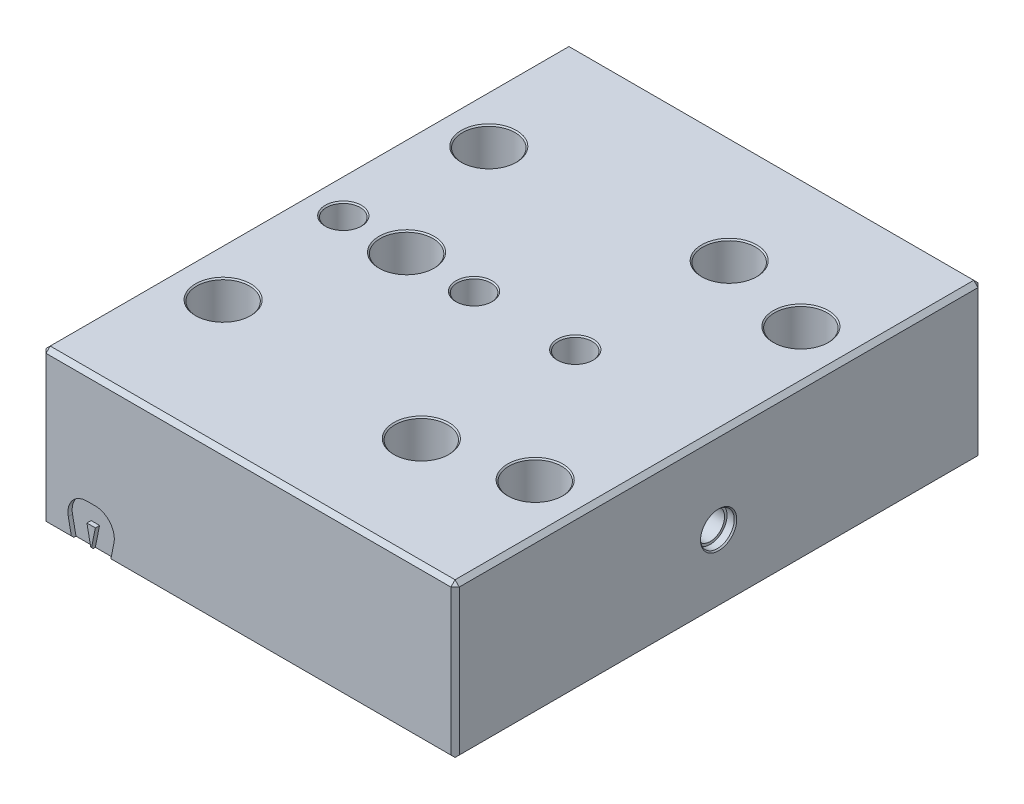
ISO-10303-21;
HEADER;
FILE_DESCRIPTION(('STEP AP214'),'2;1');
FILE_NAME('part.step','',(''),(''),'','','');
FILE_SCHEMA(('AUTOMOTIVE_DESIGN { 1 0 10303 214 1 1 1 1 }'));
ENDSEC;
DATA;
#1=APPLICATION_CONTEXT('core data for automotive mechanical design processes');
#2=APPLICATION_PROTOCOL_DEFINITION('international standard','automotive_design',2000,#1);
#3=PRODUCT_CONTEXT('',#1,'mechanical');
#4=PRODUCT('Part','Part','',(#3));
#5=PRODUCT_RELATED_PRODUCT_CATEGORY('part','',(#4));
#6=PRODUCT_DEFINITION_FORMATION('','',#4);
#7=PRODUCT_DEFINITION_CONTEXT('part definition',#1,'design');
#8=PRODUCT_DEFINITION('design','',#6,#7);
#9=PRODUCT_DEFINITION_SHAPE('','',#8);
#10=(LENGTH_UNIT() NAMED_UNIT(*) SI_UNIT(.MILLI.,.METRE.));
#11=(NAMED_UNIT(*) PLANE_ANGLE_UNIT() SI_UNIT($,.RADIAN.));
#12=(NAMED_UNIT(*) SI_UNIT($,.STERADIAN.) SOLID_ANGLE_UNIT());
#13=UNCERTAINTY_MEASURE_WITH_UNIT(LENGTH_MEASURE(1.E-05),#10,'distance_accuracy_value','');
#14=(GEOMETRIC_REPRESENTATION_CONTEXT(3) GLOBAL_UNCERTAINTY_ASSIGNED_CONTEXT((#13)) GLOBAL_UNIT_ASSIGNED_CONTEXT((#10,
#11,#12)) REPRESENTATION_CONTEXT('',''));
#15=CARTESIAN_POINT('',(0.,0.,0.));
#16=DIRECTION('',(0.,0.,1.));
#17=DIRECTION('',(1.,0.,0.));
#18=AXIS2_PLACEMENT_3D('',#15,#16,#17);
#19=CARTESIAN_POINT('',(-9.,36.,-62.5));
#20=DIRECTION('',(0.,0.,1.));
#21=DIRECTION('',(1.,0.,0.));
#22=AXIS2_PLACEMENT_3D('',#19,#20,#21);
#23=PLANE('',#22);
#24=DIRECTION('',(0.196116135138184,-0.98058067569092,0.));
#25=VECTOR('',#24,1.);
#26=CARTESIAN_POINT('',(-2.71261304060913,4.11747739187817,-62.5));
#27=LINE('',#26,#25);
#28=CARTESIAN_POINT('',(-2.71261304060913,4.11747739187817,-62.5));
#29=VERTEX_POINT('',#28);
#30=CARTESIAN_POINT('',(-1.98911756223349,0.499999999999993,-62.5));
#31=VERTEX_POINT('',#30);
#32=EDGE_CURVE('E347',#29,#31,#27,.T.);
#33=ORIENTED_EDGE('',*,*,#32,.T.);
#34=DIRECTION('',(-1.,0.,0.));
#35=VECTOR('',#34,1.);
#36=CARTESIAN_POINT('',(-9.,0.5,-62.5));
#37=LINE('',#36,#35);
#38=CARTESIAN_POINT('',(-8.,0.5,-62.5));
#39=VERTEX_POINT('',#38);
#40=EDGE_CURVE('E847',#31,#39,#37,.T.);
#41=ORIENTED_EDGE('',*,*,#40,.T.);
#42=DIRECTION('',(0.,1.,0.));
#43=VECTOR('',#42,1.);
#44=CARTESIAN_POINT('',(-8.,36.,-62.5));
#45=LINE('',#44,#43);
#46=CARTESIAN_POINT('',(-8.,35.,-62.5));
#47=VERTEX_POINT('',#46);
#48=EDGE_CURVE('E982',#39,#47,#45,.T.);
#49=ORIENTED_EDGE('',*,*,#48,.T.);
#50=DIRECTION('',(1.,0.,0.));
#51=VECTOR('',#50,1.);
#52=CARTESIAN_POINT('',(89.,35.,-62.5));
#53=LINE('',#52,#51);
#54=CARTESIAN_POINT('',(88.,35.,-62.5));
#55=VERTEX_POINT('',#54);
#56=EDGE_CURVE('E1037',#47,#55,#53,.T.);
#57=ORIENTED_EDGE('',*,*,#56,.T.);
#58=DIRECTION('',(0.,-1.,0.));
#59=VECTOR('',#58,1.);
#60=CARTESIAN_POINT('',(88.,36.,-62.5));
#61=LINE('',#60,#59);
#62=CARTESIAN_POINT('',(88.,0.499999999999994,-62.5));
#63=VERTEX_POINT('',#62);
#64=EDGE_CURVE('E1035',#55,#63,#61,.T.);
#65=ORIENTED_EDGE('',*,*,#64,.T.);
#66=CARTESIAN_POINT('',(7.38911756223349,0.5,-62.5));
#67=VERTEX_POINT('',#66);
#68=EDGE_CURVE('E862',#63,#67,#37,.T.);
#69=ORIENTED_EDGE('',*,*,#68,.T.);
#70=DIRECTION('',(0.196116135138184,0.98058067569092,0.));
#71=VECTOR('',#70,1.);
#72=CARTESIAN_POINT('',(8.11261304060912,4.11747739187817,-62.5));
#73=LINE('',#72,#71);
#74=CARTESIAN_POINT('',(8.11261304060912,4.11747739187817,-62.5));
#75=VERTEX_POINT('',#74);
#76=EDGE_CURVE('E29',#67,#75,#73,.T.);
#77=ORIENTED_EDGE('',*,*,#76,.T.);
#78=CARTESIAN_POINT('',(3.7,5.,-62.5));
#79=DIRECTION('',(0.,0.,1.));
#80=DIRECTION('',(1.,0.,0.));
#81=AXIS2_PLACEMENT_3D('',#78,#79,#80);
#82=CIRCLE('',#81,4.5);
#83=CARTESIAN_POINT('',(3.7,9.5,-62.5));
#84=VERTEX_POINT('',#83);
#85=EDGE_CURVE('E362',#75,#84,#82,.T.);
#86=ORIENTED_EDGE('',*,*,#85,.T.);
#87=DIRECTION('',(-1.,0.,0.));
#88=VECTOR('',#87,1.);
#89=CARTESIAN_POINT('',(1.7,9.5,-62.5));
#90=LINE('',#89,#88);
#91=CARTESIAN_POINT('',(1.7,9.5,-62.5));
#92=VERTEX_POINT('',#91);
#93=EDGE_CURVE('E359',#84,#92,#90,.T.);
#94=ORIENTED_EDGE('',*,*,#93,.T.);
#95=CARTESIAN_POINT('',(1.7,5.,-62.5));
#96=DIRECTION('',(0.,0.,1.));
#97=DIRECTION('',(-1.,0.,0.));
#98=AXIS2_PLACEMENT_3D('',#95,#96,#97);
#99=CIRCLE('',#98,4.5);
#100=EDGE_CURVE('E341',#92,#29,#99,.T.);
#101=ORIENTED_EDGE('',*,*,#100,.T.);
#102=EDGE_LOOP('',(#33,#41,#49,#57,#65,#69,#77,#86,#94,#101));
#103=FACE_BOUND('',#102,.T.);
#104=ADVANCED_FACE('F14',(#103),#23,.F.);
#105=CARTESIAN_POINT('',(-9.,0.,62.5));
#106=DIRECTION('',(0.,1.,0.));
#107=DIRECTION('',(0.,0.,1.));
#108=AXIS2_PLACEMENT_3D('',#105,#106,#107);
#109=PLANE('',#108);
#110=CARTESIAN_POINT('',(31.,0.,0.));
#111=DIRECTION('',(0.,1.,0.));
#112=DIRECTION('',(0.,0.,1.));
#113=AXIS2_PLACEMENT_3D('',#110,#111,#112);
#114=CIRCLE('',#113,4.2);
#115=CARTESIAN_POINT('',(31.,0.,4.2));
#116=VERTEX_POINT('',#115);
#117=EDGE_CURVE('E616',#116,#116,#114,.T.);
#118=ORIENTED_EDGE('',*,*,#117,.T.);
#119=EDGE_LOOP('',(#118));
#120=FACE_BOUND('',#119,.T.);
#121=CARTESIAN_POINT('',(55.,0.,0.));
#122=DIRECTION('',(0.,1.,0.));
#123=DIRECTION('',(0.,0.,1.));
#124=AXIS2_PLACEMENT_3D('',#121,#122,#123);
#125=CIRCLE('',#124,4.2);
#126=CARTESIAN_POINT('',(55.,0.,4.2));
#127=VERTEX_POINT('',#126);
#128=EDGE_CURVE('E610',#127,#127,#125,.T.);
#129=ORIENTED_EDGE('',*,*,#128,.T.);
#130=EDGE_LOOP('',(#129));
#131=FACE_BOUND('',#130,.T.);
#132=CARTESIAN_POINT('',(15.,0.,0.));
#133=DIRECTION('',(0.,-1.,0.));
#134=DIRECTION('',(0.,0.,-1.));
#135=AXIS2_PLACEMENT_3D('',#132,#133,#134);
#136=CIRCLE('',#135,10.3);
#137=CARTESIAN_POINT('',(15.,0.,-10.3));
#138=VERTEX_POINT('',#137);
#139=EDGE_CURVE('E568',#138,#138,#136,.T.);
#140=ORIENTED_EDGE('',*,*,#139,.F.);
#141=EDGE_LOOP('',(#140));
#142=FACE_BOUND('',#141,.T.);
#143=CARTESIAN_POINT('',(55.,0.,-36.5));
#144=DIRECTION('',(0.,-1.,0.));
#145=DIRECTION('',(0.,0.,-1.));
#146=AXIS2_PLACEMENT_3D('',#143,#144,#145);
#147=CIRCLE('',#146,10.3);
#148=CARTESIAN_POINT('',(55.,0.,-46.8));
#149=VERTEX_POINT('',#148);
#150=EDGE_CURVE('E550',#149,#149,#147,.T.);
#151=ORIENTED_EDGE('',*,*,#150,.F.);
#152=EDGE_LOOP('',(#151));
#153=FACE_BOUND('',#152,.T.);
#154=CARTESIAN_POINT('',(77.,0.,-31.5));
#155=DIRECTION('',(0.,1.,0.));
#156=DIRECTION('',(0.,0.,1.));
#157=AXIS2_PLACEMENT_3D('',#154,#155,#156);
#158=CIRCLE('',#157,6.55);
#159=CARTESIAN_POINT('',(77.,0.,-24.95));
#160=VERTEX_POINT('',#159);
#161=EDGE_CURVE('E529',#160,#160,#158,.T.);
#162=ORIENTED_EDGE('',*,*,#161,.T.);
#163=EDGE_LOOP('',(#162));
#164=FACE_BOUND('',#163,.T.);
#165=CARTESIAN_POINT('',(77.,0.,31.5));
#166=DIRECTION('',(0.,1.,0.));
#167=DIRECTION('',(0.,0.,1.));
#168=AXIS2_PLACEMENT_3D('',#165,#166,#167);
#169=CIRCLE('',#168,6.55);
#170=CARTESIAN_POINT('',(77.,0.,38.05));
#171=VERTEX_POINT('',#170);
#172=EDGE_CURVE('E517',#171,#171,#169,.T.);
#173=ORIENTED_EDGE('',*,*,#172,.T.);
#174=EDGE_LOOP('',(#173));
#175=FACE_BOUND('',#174,.T.);
#176=CARTESIAN_POINT('',(3.,0.,-31.5));
#177=DIRECTION('',(0.,1.,0.));
#178=DIRECTION('',(0.,0.,1.));
#179=AXIS2_PLACEMENT_3D('',#176,#177,#178);
#180=CIRCLE('',#179,6.55);
#181=CARTESIAN_POINT('',(3.,0.,-24.95));
#182=VERTEX_POINT('',#181);
#183=EDGE_CURVE('E499',#182,#182,#180,.T.);
#184=ORIENTED_EDGE('',*,*,#183,.T.);
#185=EDGE_LOOP('',(#184));
#186=FACE_BOUND('',#185,.T.);
#187=DIRECTION('',(0.,0.,-1.));
#188=VECTOR('',#187,1.);
#189=CARTESIAN_POINT('',(-1.8891175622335,0.,62.5));
#190=LINE('',#189,#188);
#191=CARTESIAN_POINT('',(-1.8891175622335,0.,-61.5));
#192=VERTEX_POINT('',#191);
#193=CARTESIAN_POINT('',(-1.8891175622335,0.,-62.));
#194=VERTEX_POINT('',#193);
#195=EDGE_CURVE('E378',#192,#194,#190,.T.);
#196=ORIENTED_EDGE('',*,*,#195,.F.);
#197=DIRECTION('',(1.,0.,0.));
#198=VECTOR('',#197,1.);
#199=CARTESIAN_POINT('',(-9.,0.,-61.5));
#200=LINE('',#199,#198);
#201=CARTESIAN_POINT('',(2.7,0.,-61.5));
#202=VERTEX_POINT('',#201);
#203=EDGE_CURVE('E9',#192,#202,#200,.T.);
#204=ORIENTED_EDGE('',*,*,#203,.T.);
#205=CARTESIAN_POINT('',(7.28911756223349,0.,-61.5));
#206=VERTEX_POINT('',#205);
#207=EDGE_CURVE('E18',#202,#206,#200,.T.);
#208=ORIENTED_EDGE('',*,*,#207,.T.);
#209=DIRECTION('',(0.,0.,1.));
#210=VECTOR('',#209,1.);
#211=CARTESIAN_POINT('',(7.2891175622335,0.,62.5));
#212=LINE('',#211,#210);
#213=CARTESIAN_POINT('',(7.2891175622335,0.,-62.));
#214=VERTEX_POINT('',#213);
#215=EDGE_CURVE('E371',#214,#206,#212,.T.);
#216=ORIENTED_EDGE('',*,*,#215,.F.);
#217=DIRECTION('',(1.,0.,0.));
#218=VECTOR('',#217,1.);
#219=CARTESIAN_POINT('',(-9.,0.,-62.));
#220=LINE('',#219,#218);
#221=CARTESIAN_POINT('',(88.5,0.,-62.));
#222=VERTEX_POINT('',#221);
#223=EDGE_CURVE('E927',#214,#222,#220,.T.);
#224=ORIENTED_EDGE('',*,*,#223,.T.);
#225=DIRECTION('',(0.,0.,1.));
#226=VECTOR('',#225,1.);
#227=CARTESIAN_POINT('',(88.5,0.,62.5));
#228=LINE('',#227,#226);
#229=CARTESIAN_POINT('',(88.5,0.,62.));
#230=VERTEX_POINT('',#229);
#231=EDGE_CURVE('E940',#222,#230,#228,.T.);
#232=ORIENTED_EDGE('',*,*,#231,.T.);
#233=DIRECTION('',(-1.,0.,0.));
#234=VECTOR('',#233,1.);
#235=CARTESIAN_POINT('',(-9.,0.,62.));
#236=LINE('',#235,#234);
#237=CARTESIAN_POINT('',(7.2891175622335,0.,62.));
#238=VERTEX_POINT('',#237);
#239=EDGE_CURVE('E943',#230,#238,#236,.T.);
#240=ORIENTED_EDGE('',*,*,#239,.T.);
#241=DIRECTION('',(0.,0.,-1.));
#242=VECTOR('',#241,1.);
#243=CARTESIAN_POINT('',(7.2891175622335,0.,62.5));
#244=LINE('',#243,#242);
#245=CARTESIAN_POINT('',(7.28911756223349,0.,61.5));
#246=VERTEX_POINT('',#245);
#247=EDGE_CURVE('E443',#238,#246,#244,.T.);
#248=ORIENTED_EDGE('',*,*,#247,.T.);
#249=DIRECTION('',(-1.,0.,0.));
#250=VECTOR('',#249,1.);
#251=CARTESIAN_POINT('',(-9.,0.,61.5));
#252=LINE('',#251,#250);
#253=CARTESIAN_POINT('',(2.7,0.,61.5));
#254=VERTEX_POINT('',#253);
#255=EDGE_CURVE('E898',#246,#254,#252,.T.);
#256=ORIENTED_EDGE('',*,*,#255,.T.);
#257=CARTESIAN_POINT('',(-1.8891175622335,0.,61.5));
#258=VERTEX_POINT('',#257);
#259=EDGE_CURVE('E895',#254,#258,#252,.T.);
#260=ORIENTED_EDGE('',*,*,#259,.T.);
#261=DIRECTION('',(0.,0.,1.));
#262=VECTOR('',#261,1.);
#263=CARTESIAN_POINT('',(-1.8891175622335,0.,62.5));
#264=LINE('',#263,#262);
#265=CARTESIAN_POINT('',(-1.8891175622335,0.,62.));
#266=VERTEX_POINT('',#265);
#267=EDGE_CURVE('E434',#258,#266,#264,.T.);
#268=ORIENTED_EDGE('',*,*,#267,.T.);
#269=CARTESIAN_POINT('',(-8.5,0.,62.));
#270=VERTEX_POINT('',#269);
#271=EDGE_CURVE('E942',#266,#270,#236,.T.);
#272=ORIENTED_EDGE('',*,*,#271,.T.);
#273=DIRECTION('',(0.,0.,-1.));
#274=VECTOR('',#273,1.);
#275=CARTESIAN_POINT('',(-8.5,0.,62.5));
#276=LINE('',#275,#274);
#277=CARTESIAN_POINT('',(-8.5,0.,41.8));
#278=VERTEX_POINT('',#277);
#279=EDGE_CURVE('E946',#270,#278,#276,.T.);
#280=ORIENTED_EDGE('',*,*,#279,.T.);
#281=DIRECTION('',(1.,0.,0.));
#282=VECTOR('',#281,1.);
#283=CARTESIAN_POINT('',(-9.,0.,41.8));
#284=LINE('',#283,#282);
#285=CARTESIAN_POINT('',(46.1682391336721,0.,41.8));
#286=VERTEX_POINT('',#285);
#287=EDGE_CURVE('E2147',#278,#286,#284,.T.);
#288=ORIENTED_EDGE('',*,*,#287,.T.);
#289=CARTESIAN_POINT('',(55.,0.,36.5));
#290=DIRECTION('',(0.,-1.,0.));
#291=DIRECTION('',(0.,0.,-1.));
#292=AXIS2_PLACEMENT_3D('',#289,#290,#291);
#293=CIRCLE('',#292,10.3);
#294=CARTESIAN_POINT('',(53.2631789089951,0.,26.3474903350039));
#295=VERTEX_POINT('',#294);
#296=EDGE_CURVE('E532',#295,#286,#293,.T.);
#297=ORIENTED_EDGE('',*,*,#296,.F.);
#298=CARTESIAN_POINT('',(47.5,0.,27.));
#299=DIRECTION('',(0.,1.,0.));
#300=DIRECTION('',(0.,0.,1.));
#301=AXIS2_PLACEMENT_3D('',#298,#299,#300);
#302=CIRCLE('',#301,5.8);
#303=CARTESIAN_POINT('',(47.5,0.,21.2));
#304=VERTEX_POINT('',#303);
#305=EDGE_CURVE('E2149',#295,#304,#302,.T.);
#306=ORIENTED_EDGE('',*,*,#305,.T.);
#307=DIRECTION('',(-1.,0.,0.));
#308=VECTOR('',#307,1.);
#309=CARTESIAN_POINT('',(-9.,0.,21.2));
#310=LINE('',#309,#308);
#311=CARTESIAN_POINT('',(-8.5,0.,21.2));
#312=VERTEX_POINT('',#311);
#313=EDGE_CURVE('E986',#304,#312,#310,.T.);
#314=ORIENTED_EDGE('',*,*,#313,.T.);
#315=DIRECTION('',(0.,0.,-1.));
#316=VECTOR('',#315,1.);
#317=CARTESIAN_POINT('',(-8.5,0.,62.5));
#318=LINE('',#317,#316);
#319=CARTESIAN_POINT('',(-8.5,0.,-62.));
#320=VERTEX_POINT('',#319);
#321=EDGE_CURVE('E934',#312,#320,#318,.T.);
#322=ORIENTED_EDGE('',*,*,#321,.T.);
#323=EDGE_CURVE('E931',#320,#194,#220,.T.);
#324=ORIENTED_EDGE('',*,*,#323,.T.);
#325=EDGE_LOOP('',(#196,#204,#208,#216,#224,#232,#240,#248,#256,#260,#268,#272,#280,#288,#297,
#306,#314,#322,#324));
#326=FACE_BOUND('',#325,.T.);
#327=ADVANCED_FACE('F781',(#120,#131,#142,#153,#164,#175,#186,#326),#109,.F.);
#328=CARTESIAN_POINT('',(-9.,0.5,-62.5));
#329=DIRECTION('',(0.,0.707106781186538,0.707106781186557));
#330=DIRECTION('',(0.,-0.707106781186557,0.707106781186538));
#331=AXIS2_PLACEMENT_3D('',#328,#329,#330);
#332=PLANE('',#331);
#333=ORIENTED_EDGE('',*,*,#40,.F.);
#334=DIRECTION('',(-0.140028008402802,0.700140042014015,-0.700140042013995));
#335=VECTOR('',#334,1.);
#336=CARTESIAN_POINT('',(-2.12658584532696,1.18734141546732,-63.1873414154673));
#337=LINE('',#336,#335);
#338=EDGE_CURVE('E855',#31,#194,#337,.F.);
#339=ORIENTED_EDGE('',*,*,#338,.T.);
#340=ORIENTED_EDGE('',*,*,#323,.F.);
#341=DIRECTION('',(-0.577350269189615,-0.577350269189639,0.577350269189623));
#342=VECTOR('',#341,1.);
#343=CARTESIAN_POINT('',(3.16666666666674,11.6666666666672,-73.6666666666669));
#344=LINE('',#343,#342);
#345=EDGE_CURVE('E857',#39,#320,#344,.T.);
#346=ORIENTED_EDGE('',*,*,#345,.F.);
#347=EDGE_LOOP('',(#333,#339,#340,#346));
#348=FACE_BOUND('',#347,.T.);
#349=ADVANCED_FACE('F784',(#348),#332,.F.);
#350=ORIENTED_EDGE('',*,*,#223,.F.);
#351=DIRECTION('',(-0.140028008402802,-0.700140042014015,0.700140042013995));
#352=VECTOR('',#351,1.);
#353=CARTESIAN_POINT('',(7.06776231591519,-1.10677623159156,-60.8932237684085));
#354=LINE('',#353,#352);
#355=EDGE_CURVE('E903',#214,#67,#354,.F.);
#356=ORIENTED_EDGE('',*,*,#355,.T.);
#357=ORIENTED_EDGE('',*,*,#68,.F.);
#358=DIRECTION('',(-0.577350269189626,0.577350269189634,-0.577350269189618));
#359=VECTOR('',#358,1.);
#360=CARTESIAN_POINT('',(76.1666666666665,12.3333333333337,-74.3333333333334));
#361=LINE('',#360,#359);
#362=EDGE_CURVE('E928',#222,#63,#361,.T.);
#363=ORIENTED_EDGE('',*,*,#362,.F.);
#364=EDGE_LOOP('',(#350,#356,#357,#363));
#365=FACE_BOUND('',#364,.T.);
#366=ADVANCED_FACE('F925',(#365),#332,.F.);
#367=CARTESIAN_POINT('',(-9.,0.5,62.5));
#368=DIRECTION('',(0.,0.707106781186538,-0.707106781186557));
#369=DIRECTION('',(0.,0.707106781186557,0.707106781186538));
#370=AXIS2_PLACEMENT_3D('',#367,#368,#369);
#371=PLANE('',#370);
#372=DIRECTION('',(-0.140028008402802,-0.700140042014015,-0.700140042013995));
#373=VECTOR('',#372,1.);
#374=CARTESIAN_POINT('',(7.06776231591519,-1.10677623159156,60.8932237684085));
#375=LINE('',#374,#373);
#376=CARTESIAN_POINT('',(7.38911756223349,0.5,62.5));
#377=VERTEX_POINT('',#376);
#378=EDGE_CURVE('E893',#238,#377,#375,.F.);
#379=ORIENTED_EDGE('',*,*,#378,.F.);
#380=ORIENTED_EDGE('',*,*,#239,.F.);
#381=DIRECTION('',(0.577350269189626,-0.577350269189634,-0.577350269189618));
#382=VECTOR('',#381,1.);
#383=CARTESIAN_POINT('',(76.8333333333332,11.666666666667,73.6666666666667));
#384=LINE('',#383,#382);
#385=CARTESIAN_POINT('',(88.,0.499999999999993,62.5));
#386=VERTEX_POINT('',#385);
#387=EDGE_CURVE('E948',#386,#230,#384,.T.);
#388=ORIENTED_EDGE('',*,*,#387,.F.);
#389=DIRECTION('',(1.,0.,0.));
#390=VECTOR('',#389,1.);
#391=CARTESIAN_POINT('',(-9.,0.5,62.5));
#392=LINE('',#391,#390);
#393=EDGE_CURVE('E952',#377,#386,#392,.T.);
#394=ORIENTED_EDGE('',*,*,#393,.F.);
#395=EDGE_LOOP('',(#379,#380,#388,#394));
#396=FACE_BOUND('',#395,.T.);
#397=ADVANCED_FACE('F1139',(#396),#371,.F.);
#398=CARTESIAN_POINT('',(3.,36.,31.5));
#399=DIRECTION('',(0.,1.,0.));
#400=DIRECTION('',(0.,0.,1.));
#401=AXIS2_PLACEMENT_3D('',#398,#399,#400);
#402=CYLINDRICAL_SURFACE('',#401,6.25);
#403=CARTESIAN_POINT('',(3.,35.7,31.5));
#404=DIRECTION('',(0.,1.,0.));
#405=DIRECTION('',(0.,0.,1.));
#406=AXIS2_PLACEMENT_3D('',#403,#404,#405);
#407=CIRCLE('',#406,6.25);
#408=CARTESIAN_POINT('',(3.,35.7,37.75));
#409=VERTEX_POINT('',#408);
#410=EDGE_CURVE('E505',#409,#409,#407,.T.);
#411=ORIENTED_EDGE('',*,*,#410,.T.);
#412=EDGE_LOOP('',(#411));
#413=FACE_BOUND('',#412,.T.);
#414=CARTESIAN_POINT('',(3.,6.,31.5));
#415=DIRECTION('',(0.,-1.,0.));
#416=DIRECTION('',(0.,0.,-1.));
#417=AXIS2_PLACEMENT_3D('',#414,#415,#416);
#418=CIRCLE('',#417,6.25);
#419=CARTESIAN_POINT('',(3.,6.,25.25));
#420=VERTEX_POINT('',#419);
#421=EDGE_CURVE('E475',#420,#420,#418,.F.);
#422=ORIENTED_EDGE('',*,*,#421,.F.);
#423=EDGE_LOOP('',(#422));
#424=FACE_BOUND('',#423,.T.);
#425=ADVANCED_FACE('F802',(#413,#424),#402,.F.);
#426=CARTESIAN_POINT('',(-9.,36.,-62.5));
#427=DIRECTION('',(1.,0.,0.));
#428=DIRECTION('',(0.,0.,-1.));
#429=AXIS2_PLACEMENT_3D('',#426,#427,#428);
#430=PLANE('',#429);
#431=CARTESIAN_POINT('',(-9.,16.,0.));
#432=DIRECTION('',(1.,0.,0.));
#433=DIRECTION('',(0.,0.,-1.));
#434=AXIS2_PLACEMENT_3D('',#431,#432,#433);
#435=CIRCLE('',#434,4.3);
#436=CARTESIAN_POINT('',(-9.,16.,-4.3));
#437=VERTEX_POINT('',#436);
#438=EDGE_CURVE('E882',#437,#437,#435,.T.);
#439=ORIENTED_EDGE('',*,*,#438,.T.);
#440=EDGE_LOOP('',(#439));
#441=FACE_BOUND('',#440,.T.);
#442=DIRECTION('',(0.,-1.,0.));
#443=VECTOR('',#442,1.);
#444=CARTESIAN_POINT('',(-9.,36.,41.8));
#445=LINE('',#444,#443);
#446=CARTESIAN_POINT('',(-9.,6.3,41.8));
#447=VERTEX_POINT('',#446);
#448=CARTESIAN_POINT('',(-9.,0.5,41.8));
#449=VERTEX_POINT('',#448);
#450=EDGE_CURVE('E1006',#447,#449,#445,.T.);
#451=ORIENTED_EDGE('',*,*,#450,.T.);
#452=DIRECTION('',(0.,0.,1.));
#453=VECTOR('',#452,1.);
#454=CARTESIAN_POINT('',(-9.,0.5,-62.5));
#455=LINE('',#454,#453);
#456=CARTESIAN_POINT('',(-9.,0.5,61.5));
#457=VERTEX_POINT('',#456);
#458=EDGE_CURVE('E965',#449,#457,#455,.T.);
#459=ORIENTED_EDGE('',*,*,#458,.T.);
#460=DIRECTION('',(0.,1.,0.));
#461=VECTOR('',#460,1.);
#462=CARTESIAN_POINT('',(-9.,36.,61.5));
#463=LINE('',#462,#461);
#464=CARTESIAN_POINT('',(-9.,35.,61.5));
#465=VERTEX_POINT('',#464);
#466=EDGE_CURVE('E1032',#457,#465,#463,.T.);
#467=ORIENTED_EDGE('',*,*,#466,.T.);
#468=DIRECTION('',(0.,0.,-1.));
#469=VECTOR('',#468,1.);
#470=CARTESIAN_POINT('',(-9.,35.,-62.5));
#471=LINE('',#470,#469);
#472=CARTESIAN_POINT('',(-9.,35.,-61.5));
#473=VERTEX_POINT('',#472);
#474=EDGE_CURVE('E1019',#465,#473,#471,.T.);
#475=ORIENTED_EDGE('',*,*,#474,.T.);
#476=DIRECTION('',(0.,-1.,0.));
#477=VECTOR('',#476,1.);
#478=CARTESIAN_POINT('',(-9.,36.,-61.5));
#479=LINE('',#478,#477);
#480=CARTESIAN_POINT('',(-9.,0.500000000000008,-61.5));
#481=VERTEX_POINT('',#480);
#482=EDGE_CURVE('E996',#473,#481,#479,.T.);
#483=ORIENTED_EDGE('',*,*,#482,.T.);
#484=DIRECTION('',(0.,0.,1.));
#485=VECTOR('',#484,1.);
#486=CARTESIAN_POINT('',(-9.,0.5,-62.5));
#487=LINE('',#486,#485);
#488=CARTESIAN_POINT('',(-9.,0.5,21.2));
#489=VERTEX_POINT('',#488);
#490=EDGE_CURVE('E962',#481,#489,#487,.T.);
#491=ORIENTED_EDGE('',*,*,#490,.T.);
#492=DIRECTION('',(0.,1.,0.));
#493=VECTOR('',#492,1.);
#494=CARTESIAN_POINT('',(-9.,36.,21.2));
#495=LINE('',#494,#493);
#496=CARTESIAN_POINT('',(-9.,6.3,21.2));
#497=VERTEX_POINT('',#496);
#498=EDGE_CURVE('E994',#489,#497,#495,.T.);
#499=ORIENTED_EDGE('',*,*,#498,.T.);
#500=DIRECTION('',(0.,0.,1.));
#501=VECTOR('',#500,1.);
#502=CARTESIAN_POINT('',(-9.,6.3,41.5));
#503=LINE('',#502,#501);
#504=EDGE_CURVE('E1003',#497,#447,#503,.T.);
#505=ORIENTED_EDGE('',*,*,#504,.T.);
#506=EDGE_LOOP('',(#451,#459,#467,#475,#483,#491,#499,#505));
#507=FACE_BOUND('',#506,.T.);
#508=ADVANCED_FACE('F797',(#441,#507),#430,.F.);
#509=CARTESIAN_POINT('',(-9.,36.,62.5));
#510=DIRECTION('',(0.,0.,-1.));
#511=DIRECTION('',(-1.,0.,0.));
#512=AXIS2_PLACEMENT_3D('',#509,#510,#511);
#513=PLANE('',#512);
#514=CARTESIAN_POINT('',(3.7,5.,62.5));
#515=DIRECTION('',(0.,0.,1.));
#516=DIRECTION('',(1.,0.,0.));
#517=AXIS2_PLACEMENT_3D('',#514,#515,#516);
#518=CIRCLE('',#517,4.5);
#519=CARTESIAN_POINT('',(8.11261304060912,4.11747739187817,62.5));
#520=VERTEX_POINT('',#519);
#521=CARTESIAN_POINT('',(3.7,9.5,62.5));
#522=VERTEX_POINT('',#521);
#523=EDGE_CURVE('E427',#520,#522,#518,.T.);
#524=ORIENTED_EDGE('',*,*,#523,.F.);
#525=DIRECTION('',(0.196116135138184,0.98058067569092,0.));
#526=VECTOR('',#525,1.);
#527=CARTESIAN_POINT('',(8.11261304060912,4.11747739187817,62.5));
#528=LINE('',#527,#526);
#529=EDGE_CURVE('E425',#377,#520,#528,.T.);
#530=ORIENTED_EDGE('',*,*,#529,.F.);
#531=ORIENTED_EDGE('',*,*,#393,.T.);
#532=DIRECTION('',(0.,1.,0.));
#533=VECTOR('',#532,1.);
#534=CARTESIAN_POINT('',(88.,36.,62.5));
#535=LINE('',#534,#533);
#536=CARTESIAN_POINT('',(88.,35.,62.5));
#537=VERTEX_POINT('',#536);
#538=EDGE_CURVE('E1056',#386,#537,#535,.T.);
#539=ORIENTED_EDGE('',*,*,#538,.T.);
#540=DIRECTION('',(-1.,0.,0.));
#541=VECTOR('',#540,1.);
#542=CARTESIAN_POINT('',(-9.,35.,62.5));
#543=LINE('',#542,#541);
#544=CARTESIAN_POINT('',(-8.,35.,62.5));
#545=VERTEX_POINT('',#544);
#546=EDGE_CURVE('E1058',#537,#545,#543,.T.);
#547=ORIENTED_EDGE('',*,*,#546,.T.);
#548=DIRECTION('',(0.,-1.,0.));
#549=VECTOR('',#548,1.);
#550=CARTESIAN_POINT('',(-8.,36.,62.5));
#551=LINE('',#550,#549);
#552=CARTESIAN_POINT('',(-8.,0.499999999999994,62.5));
#553=VERTEX_POINT('',#552);
#554=EDGE_CURVE('E1060',#545,#553,#551,.T.);
#555=ORIENTED_EDGE('',*,*,#554,.T.);
#556=CARTESIAN_POINT('',(-1.98911756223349,0.5,62.5));
#557=VERTEX_POINT('',#556);
#558=EDGE_CURVE('E953',#553,#557,#392,.T.);
#559=ORIENTED_EDGE('',*,*,#558,.T.);
#560=DIRECTION('',(0.196116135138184,-0.98058067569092,0.));
#561=VECTOR('',#560,1.);
#562=CARTESIAN_POINT('',(-2.71261304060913,4.11747739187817,62.5));
#563=LINE('',#562,#561);
#564=CARTESIAN_POINT('',(-2.71261304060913,4.11747739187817,62.5));
#565=VERTEX_POINT('',#564);
#566=EDGE_CURVE('E423',#565,#557,#563,.T.);
#567=ORIENTED_EDGE('',*,*,#566,.F.);
#568=CARTESIAN_POINT('',(1.7,5.,62.5));
#569=DIRECTION('',(0.,0.,1.));
#570=DIRECTION('',(-1.,0.,0.));
#571=AXIS2_PLACEMENT_3D('',#568,#569,#570);
#572=CIRCLE('',#571,4.5);
#573=CARTESIAN_POINT('',(1.7,9.5,62.5));
#574=VERTEX_POINT('',#573);
#575=EDGE_CURVE('E401',#574,#565,#572,.T.);
#576=ORIENTED_EDGE('',*,*,#575,.F.);
#577=DIRECTION('',(-1.,0.,0.));
#578=VECTOR('',#577,1.);
#579=CARTESIAN_POINT('',(1.7,9.5,62.5));
#580=LINE('',#579,#578);
#581=EDGE_CURVE('E409',#522,#574,#580,.T.);
#582=ORIENTED_EDGE('',*,*,#581,.F.);
#583=EDGE_LOOP('',(#524,#530,#531,#539,#547,#555,#559,#567,#576,#582));
#584=FACE_BOUND('',#583,.T.);
#585=ADVANCED_FACE('F793',(#584),#513,.F.);
#586=CARTESIAN_POINT('',(89.,36.,-62.5));
#587=DIRECTION('',(-1.,0.,0.));
#588=DIRECTION('',(0.,0.,1.));
#589=AXIS2_PLACEMENT_3D('',#586,#587,#588);
#590=PLANE('',#589);
#591=CARTESIAN_POINT('',(89.,16.,0.));
#592=DIRECTION('',(-1.,0.,0.));
#593=DIRECTION('',(0.,0.,1.));
#594=AXIS2_PLACEMENT_3D('',#591,#592,#593);
#595=CIRCLE('',#594,4.3);
#596=CARTESIAN_POINT('',(89.,16.,4.3));
#597=VERTEX_POINT('',#596);
#598=EDGE_CURVE('E871',#597,#597,#595,.T.);
#599=ORIENTED_EDGE('',*,*,#598,.T.);
#600=EDGE_LOOP('',(#599));
#601=FACE_BOUND('',#600,.T.);
#602=DIRECTION('',(0.,-1.,0.));
#603=VECTOR('',#602,1.);
#604=CARTESIAN_POINT('',(89.,36.,61.5));
#605=LINE('',#604,#603);
#606=CARTESIAN_POINT('',(89.,35.,61.5));
#607=VERTEX_POINT('',#606);
#608=CARTESIAN_POINT('',(89.,0.499999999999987,61.5));
#609=VERTEX_POINT('',#608);
#610=EDGE_CURVE('E1051',#607,#609,#605,.T.);
#611=ORIENTED_EDGE('',*,*,#610,.T.);
#612=DIRECTION('',(0.,0.,-1.));
#613=VECTOR('',#612,1.);
#614=CARTESIAN_POINT('',(89.,0.5,-62.5));
#615=LINE('',#614,#613);
#616=CARTESIAN_POINT('',(89.,0.5,-61.5));
#617=VERTEX_POINT('',#616);
#618=EDGE_CURVE('E1063',#609,#617,#615,.T.);
#619=ORIENTED_EDGE('',*,*,#618,.T.);
#620=DIRECTION('',(0.,1.,0.));
#621=VECTOR('',#620,1.);
#622=CARTESIAN_POINT('',(89.,36.,-61.5));
#623=LINE('',#622,#621);
#624=CARTESIAN_POINT('',(89.,35.,-61.5));
#625=VERTEX_POINT('',#624);
#626=EDGE_CURVE('E1054',#617,#625,#623,.T.);
#627=ORIENTED_EDGE('',*,*,#626,.T.);
#628=DIRECTION('',(0.,0.,1.));
#629=VECTOR('',#628,1.);
#630=CARTESIAN_POINT('',(89.,35.,62.5));
#631=LINE('',#630,#629);
#632=EDGE_CURVE('E1049',#625,#607,#631,.T.);
#633=ORIENTED_EDGE('',*,*,#632,.T.);
#634=EDGE_LOOP('',(#611,#619,#627,#633));
#635=FACE_BOUND('',#634,.T.);
#636=ADVANCED_FACE('F779',(#601,#635),#590,.F.);
#637=CARTESIAN_POINT('',(-9.,36.,62.5));
#638=DIRECTION('',(0.,1.,0.));
#639=DIRECTION('',(0.,0.,1.));
#640=AXIS2_PLACEMENT_3D('',#637,#638,#639);
#641=PLANE('',#640);
#642=DIRECTION('',(0.,0.,-1.));
#643=VECTOR('',#642,1.);
#644=CARTESIAN_POINT('',(88.,36.,-62.5));
#645=LINE('',#644,#643);
#646=CARTESIAN_POINT('',(88.,36.,61.5));
#647=VERTEX_POINT('',#646);
#648=CARTESIAN_POINT('',(88.,36.,-61.5));
#649=VERTEX_POINT('',#648);
#650=EDGE_CURVE('E1040',#647,#649,#645,.T.);
#651=ORIENTED_EDGE('',*,*,#650,.T.);
#652=DIRECTION('',(-1.,0.,0.));
#653=VECTOR('',#652,1.);
#654=CARTESIAN_POINT('',(-9.,36.,-61.5));
#655=LINE('',#654,#653);
#656=CARTESIAN_POINT('',(-8.,36.,-61.5));
#657=VERTEX_POINT('',#656);
#658=EDGE_CURVE('E1046',#649,#657,#655,.T.);
#659=ORIENTED_EDGE('',*,*,#658,.T.);
#660=DIRECTION('',(0.,0.,1.));
#661=VECTOR('',#660,1.);
#662=CARTESIAN_POINT('',(-8.,36.,62.5));
#663=LINE('',#662,#661);
#664=CARTESIAN_POINT('',(-8.,36.,61.5));
#665=VERTEX_POINT('',#664);
#666=EDGE_CURVE('E1044',#657,#665,#663,.T.);
#667=ORIENTED_EDGE('',*,*,#666,.T.);
#668=DIRECTION('',(1.,0.,0.));
#669=VECTOR('',#668,1.);
#670=CARTESIAN_POINT('',(89.,36.,61.5));
#671=LINE('',#670,#669);
#672=EDGE_CURVE('E1042',#665,#647,#671,.T.);
#673=ORIENTED_EDGE('',*,*,#672,.T.);
#674=EDGE_LOOP('',(#651,#659,#667,#673));
#675=FACE_BOUND('',#674,.T.);
#676=CARTESIAN_POINT('',(3.,36.,-31.5));
#677=DIRECTION('',(0.,1.,0.));
#678=DIRECTION('',(0.,0.,1.));
#679=AXIS2_PLACEMENT_3D('',#676,#677,#678);
#680=CIRCLE('',#679,6.55);
#681=CARTESIAN_POINT('',(3.,36.,-24.95));
#682=VERTEX_POINT('',#681);
#683=EDGE_CURVE('E490',#682,#682,#680,.T.);
#684=ORIENTED_EDGE('',*,*,#683,.F.);
#685=EDGE_LOOP('',(#684));
#686=FACE_BOUND('',#685,.T.);
#687=CARTESIAN_POINT('',(3.,36.,31.5));
#688=DIRECTION('',(0.,1.,0.));
#689=DIRECTION('',(0.,0.,1.));
#690=AXIS2_PLACEMENT_3D('',#687,#688,#689);
#691=CIRCLE('',#690,6.55);
#692=CARTESIAN_POINT('',(3.,36.,38.05));
#693=VERTEX_POINT('',#692);
#694=EDGE_CURVE('E502',#693,#693,#691,.T.);
#695=ORIENTED_EDGE('',*,*,#694,.F.);
#696=EDGE_LOOP('',(#695));
#697=FACE_BOUND('',#696,.T.);
#698=CARTESIAN_POINT('',(77.,36.,31.5));
#699=DIRECTION('',(0.,1.,0.));
#700=DIRECTION('',(0.,0.,1.));
#701=AXIS2_PLACEMENT_3D('',#698,#699,#700);
#702=CIRCLE('',#701,6.55);
#703=CARTESIAN_POINT('',(77.,36.,38.05));
#704=VERTEX_POINT('',#703);
#705=EDGE_CURVE('E508',#704,#704,#702,.T.);
#706=ORIENTED_EDGE('',*,*,#705,.F.);
#707=EDGE_LOOP('',(#706));
#708=FACE_BOUND('',#707,.T.);
#709=CARTESIAN_POINT('',(77.,36.,-31.5));
#710=DIRECTION('',(0.,1.,0.));
#711=DIRECTION('',(0.,0.,1.));
#712=AXIS2_PLACEMENT_3D('',#709,#710,#711);
#713=CIRCLE('',#712,6.55);
#714=CARTESIAN_POINT('',(77.,36.,-24.95));
#715=VERTEX_POINT('',#714);
#716=EDGE_CURVE('E520',#715,#715,#713,.T.);
#717=ORIENTED_EDGE('',*,*,#716,.F.);
#718=EDGE_LOOP('',(#717));
#719=FACE_BOUND('',#718,.T.);
#720=CARTESIAN_POINT('',(55.,36.,36.5));
#721=DIRECTION('',(0.,-1.,0.));
#722=DIRECTION('',(0.,0.,-1.));
#723=AXIS2_PLACEMENT_3D('',#720,#721,#722);
#724=CIRCLE('',#723,6.55);
#725=CARTESIAN_POINT('',(55.,36.,29.95));
#726=VERTEX_POINT('',#725);
#727=EDGE_CURVE('E547',#726,#726,#724,.T.);
#728=ORIENTED_EDGE('',*,*,#727,.T.);
#729=EDGE_LOOP('',(#728));
#730=FACE_BOUND('',#729,.T.);
#731=CARTESIAN_POINT('',(55.,36.,-36.5));
#732=DIRECTION('',(0.,-1.,0.));
#733=DIRECTION('',(0.,0.,-1.));
#734=AXIS2_PLACEMENT_3D('',#731,#732,#733);
#735=CIRCLE('',#734,6.55);
#736=CARTESIAN_POINT('',(55.,36.,-43.05));
#737=VERTEX_POINT('',#736);
#738=EDGE_CURVE('E565',#737,#737,#735,.T.);
#739=ORIENTED_EDGE('',*,*,#738,.T.);
#740=EDGE_LOOP('',(#739));
#741=FACE_BOUND('',#740,.T.);
#742=CARTESIAN_POINT('',(15.,36.,0.));
#743=DIRECTION('',(0.,-1.,0.));
#744=DIRECTION('',(0.,0.,-1.));
#745=AXIS2_PLACEMENT_3D('',#742,#743,#744);
#746=CIRCLE('',#745,6.55);
#747=CARTESIAN_POINT('',(15.,36.,-6.55));
#748=VERTEX_POINT('',#747);
#749=EDGE_CURVE('E583',#748,#748,#746,.T.);
#750=ORIENTED_EDGE('',*,*,#749,.T.);
#751=EDGE_LOOP('',(#750));
#752=FACE_BOUND('',#751,.T.);
#753=CARTESIAN_POINT('',(55.,36.,0.));
#754=DIRECTION('',(0.,1.,0.));
#755=DIRECTION('',(0.,0.,1.));
#756=AXIS2_PLACEMENT_3D('',#753,#754,#755);
#757=CIRCLE('',#756,4.3);
#758=CARTESIAN_POINT('',(55.,36.,4.3));
#759=VERTEX_POINT('',#758);
#760=EDGE_CURVE('E628',#759,#759,#757,.F.);
#761=ORIENTED_EDGE('',*,*,#760,.T.);
#762=EDGE_LOOP('',(#761));
#763=FACE_BOUND('',#762,.T.);
#764=CARTESIAN_POINT('',(31.,36.,0.));
#765=DIRECTION('',(0.,1.,0.));
#766=DIRECTION('',(0.,0.,1.));
#767=AXIS2_PLACEMENT_3D('',#764,#765,#766);
#768=CIRCLE('',#767,4.3);
#769=CARTESIAN_POINT('',(31.,36.,4.3));
#770=VERTEX_POINT('',#769);
#771=EDGE_CURVE('E625',#770,#770,#768,.F.);
#772=ORIENTED_EDGE('',*,*,#771,.T.);
#773=EDGE_LOOP('',(#772));
#774=FACE_BOUND('',#773,.T.);
#775=CARTESIAN_POINT('',(0.,36.,0.));
#776=DIRECTION('',(0.,1.,0.));
#777=DIRECTION('',(0.,0.,1.));
#778=AXIS2_PLACEMENT_3D('',#775,#776,#777);
#779=CIRCLE('',#778,4.3);
#780=CARTESIAN_POINT('',(0.,36.,4.3));
#781=VERTEX_POINT('',#780);
#782=EDGE_CURVE('E622',#781,#781,#779,.F.);
#783=ORIENTED_EDGE('',*,*,#782,.T.);
#784=EDGE_LOOP('',(#783));
#785=FACE_BOUND('',#784,.T.);
#786=ADVANCED_FACE('F775',(#675,#686,#697,#708,#719,#730,#741,#752,#763,#774,#785),#641,.T.);
#787=CARTESIAN_POINT('',(31.,0.3,0.));
#788=DIRECTION('',(0.,-1.,0.));
#789=DIRECTION('',(0.,0.,-1.));
#790=AXIS2_PLACEMENT_3D('',#787,#788,#789);
#791=CONICAL_SURFACE('',#790,3.9,0.785398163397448);
#792=ORIENTED_EDGE('',*,*,#117,.F.);
#793=EDGE_LOOP('',(#792));
#794=FACE_BOUND('',#793,.T.);
#795=CARTESIAN_POINT('',(31.,0.3,0.));
#796=DIRECTION('',(0.,1.,0.));
#797=DIRECTION('',(0.,0.,1.));
#798=AXIS2_PLACEMENT_3D('',#795,#796,#797);
#799=CIRCLE('',#798,3.9);
#800=CARTESIAN_POINT('',(31.,0.3,3.9));
#801=VERTEX_POINT('',#800);
#802=EDGE_CURVE('E613',#801,#801,#799,.T.);
#803=ORIENTED_EDGE('',*,*,#802,.T.);
#804=EDGE_LOOP('',(#803));
#805=FACE_BOUND('',#804,.T.);
#806=ADVANCED_FACE('F771',(#794,#805),#791,.F.);
#807=CARTESIAN_POINT('',(31.,36.,0.));
#808=DIRECTION('',(0.,1.,0.));
#809=DIRECTION('',(0.,0.,1.));
#810=AXIS2_PLACEMENT_3D('',#807,#808,#809);
#811=CYLINDRICAL_SURFACE('',#810,3.9);
#812=ORIENTED_EDGE('',*,*,#802,.F.);
#813=EDGE_LOOP('',(#812));
#814=FACE_BOUND('',#813,.T.);
#815=CARTESIAN_POINT('',(31.,26.,0.));
#816=DIRECTION('',(0.,1.,0.));
#817=DIRECTION('',(0.,0.,1.));
#818=AXIS2_PLACEMENT_3D('',#815,#816,#817);
#819=CIRCLE('',#818,3.9);
#820=CARTESIAN_POINT('',(31.,26.,3.9));
#821=VERTEX_POINT('',#820);
#822=EDGE_CURVE('E598',#821,#821,#819,.T.);
#823=ORIENTED_EDGE('',*,*,#822,.T.);
#824=EDGE_LOOP('',(#823));
#825=FACE_BOUND('',#824,.T.);
#826=ADVANCED_FACE('F767',(#814,#825),#811,.F.);
#827=CARTESIAN_POINT('',(55.,0.3,0.));
#828=DIRECTION('',(0.,-1.,0.));
#829=DIRECTION('',(0.,0.,-1.));
#830=AXIS2_PLACEMENT_3D('',#827,#828,#829);
#831=CONICAL_SURFACE('',#830,3.9,0.785398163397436);
#832=ORIENTED_EDGE('',*,*,#128,.F.);
#833=EDGE_LOOP('',(#832));
#834=FACE_BOUND('',#833,.T.);
#835=CARTESIAN_POINT('',(55.,0.3,0.));
#836=DIRECTION('',(0.,1.,0.));
#837=DIRECTION('',(0.,0.,1.));
#838=AXIS2_PLACEMENT_3D('',#835,#836,#837);
#839=CIRCLE('',#838,3.9);
#840=CARTESIAN_POINT('',(55.,0.3,3.9));
#841=VERTEX_POINT('',#840);
#842=EDGE_CURVE('E607',#841,#841,#839,.T.);
#843=ORIENTED_EDGE('',*,*,#842,.T.);
#844=EDGE_LOOP('',(#843));
#845=FACE_BOUND('',#844,.T.);
#846=ADVANCED_FACE('F763',(#834,#845),#831,.F.);
#847=CARTESIAN_POINT('',(55.,36.,0.));
#848=DIRECTION('',(0.,1.,0.));
#849=DIRECTION('',(0.,0.,1.));
#850=AXIS2_PLACEMENT_3D('',#847,#848,#849);
#851=CYLINDRICAL_SURFACE('',#850,3.9);
#852=ORIENTED_EDGE('',*,*,#842,.F.);
#853=EDGE_LOOP('',(#852));
#854=FACE_BOUND('',#853,.T.);
#855=CARTESIAN_POINT('',(55.,26.,0.));
#856=DIRECTION('',(0.,1.,0.));
#857=DIRECTION('',(0.,0.,1.));
#858=AXIS2_PLACEMENT_3D('',#855,#856,#857);
#859=CIRCLE('',#858,3.9);
#860=CARTESIAN_POINT('',(55.,26.,3.9));
#861=VERTEX_POINT('',#860);
#862=EDGE_CURVE('E604',#861,#861,#859,.T.);
#863=ORIENTED_EDGE('',*,*,#862,.T.);
#864=EDGE_LOOP('',(#863));
#865=FACE_BOUND('',#864,.T.);
#866=ADVANCED_FACE('F759',(#854,#865),#851,.F.);
#867=CARTESIAN_POINT('',(58.9,26.,0.));
#868=DIRECTION('',(0.,-1.,0.));
#869=DIRECTION('',(0.,0.,-1.));
#870=AXIS2_PLACEMENT_3D('',#867,#868,#869);
#871=PLANE('',#870);
#872=ORIENTED_EDGE('',*,*,#862,.F.);
#873=EDGE_LOOP('',(#872));
#874=FACE_BOUND('',#873,.T.);
#875=CARTESIAN_POINT('',(55.,26.,0.));
#876=DIRECTION('',(0.,1.,0.));
#877=DIRECTION('',(0.,0.,1.));
#878=AXIS2_PLACEMENT_3D('',#875,#876,#877);
#879=CIRCLE('',#878,4.);
#880=CARTESIAN_POINT('',(55.,26.,4.));
#881=VERTEX_POINT('',#880);
#882=EDGE_CURVE('E601',#881,#881,#879,.T.);
#883=ORIENTED_EDGE('',*,*,#882,.T.);
#884=EDGE_LOOP('',(#883));
#885=FACE_BOUND('',#884,.T.);
#886=ADVANCED_FACE('F755',(#874,#885),#871,.F.);
#887=CARTESIAN_POINT('',(55.,36.,0.));
#888=DIRECTION('',(0.,1.,0.));
#889=DIRECTION('',(0.,0.,1.));
#890=AXIS2_PLACEMENT_3D('',#887,#888,#889);
#891=CYLINDRICAL_SURFACE('',#890,4.);
#892=CARTESIAN_POINT('',(55.,35.7,0.));
#893=DIRECTION('',(0.,1.,0.));
#894=DIRECTION('',(0.,0.,1.));
#895=AXIS2_PLACEMENT_3D('',#892,#893,#894);
#896=CIRCLE('',#895,4.);
#897=CARTESIAN_POINT('',(55.,35.7,4.));
#898=VERTEX_POINT('',#897);
#899=EDGE_CURVE('E619',#898,#898,#896,.T.);
#900=ORIENTED_EDGE('',*,*,#899,.T.);
#901=EDGE_LOOP('',(#900));
#902=FACE_BOUND('',#901,.T.);
#903=ORIENTED_EDGE('',*,*,#882,.F.);
#904=EDGE_LOOP('',(#903));
#905=FACE_BOUND('',#904,.T.);
#906=ADVANCED_FACE('F751',(#902,#905),#891,.F.);
#907=CARTESIAN_POINT('',(34.9,26.,0.));
#908=DIRECTION('',(0.,-1.,0.));
#909=DIRECTION('',(0.,0.,-1.));
#910=AXIS2_PLACEMENT_3D('',#907,#908,#909);
#911=PLANE('',#910);
#912=ORIENTED_EDGE('',*,*,#822,.F.);
#913=EDGE_LOOP('',(#912));
#914=FACE_BOUND('',#913,.T.);
#915=CARTESIAN_POINT('',(31.,26.,0.));
#916=DIRECTION('',(0.,1.,0.));
#917=DIRECTION('',(0.,0.,1.));
#918=AXIS2_PLACEMENT_3D('',#915,#916,#917);
#919=CIRCLE('',#918,4.);
#920=CARTESIAN_POINT('',(31.,26.,4.));
#921=VERTEX_POINT('',#920);
#922=EDGE_CURVE('E595',#921,#921,#919,.T.);
#923=ORIENTED_EDGE('',*,*,#922,.T.);
#924=EDGE_LOOP('',(#923));
#925=FACE_BOUND('',#924,.T.);
#926=ADVANCED_FACE('F747',(#914,#925),#911,.F.);
#927=CARTESIAN_POINT('',(31.,36.,0.));
#928=DIRECTION('',(0.,1.,0.));
#929=DIRECTION('',(0.,0.,1.));
#930=AXIS2_PLACEMENT_3D('',#927,#928,#929);
#931=CYLINDRICAL_SURFACE('',#930,4.);
#932=CARTESIAN_POINT('',(31.,35.7,0.));
#933=DIRECTION('',(0.,1.,0.));
#934=DIRECTION('',(0.,0.,1.));
#935=AXIS2_PLACEMENT_3D('',#932,#933,#934);
#936=CIRCLE('',#935,4.);
#937=CARTESIAN_POINT('',(31.,35.7,4.));
#938=VERTEX_POINT('',#937);
#939=EDGE_CURVE('E631',#938,#938,#936,.T.);
#940=ORIENTED_EDGE('',*,*,#939,.T.);
#941=EDGE_LOOP('',(#940));
#942=FACE_BOUND('',#941,.T.);
#943=ORIENTED_EDGE('',*,*,#922,.F.);
#944=EDGE_LOOP('',(#943));
#945=FACE_BOUND('',#944,.T.);
#946=ADVANCED_FACE('F743',(#942,#945),#931,.F.);
#947=CARTESIAN_POINT('',(0.,24.,0.));
#948=DIRECTION('',(0.,1.,0.));
#949=DIRECTION('',(0.,0.,1.));
#950=AXIS2_PLACEMENT_3D('',#947,#948,#949);
#951=CONICAL_SURFACE('',#950,3.9,1.02974425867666);
#952=CARTESIAN_POINT('',(0.,21.6566435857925,0.));
#953=VERTEX_POINT('',#952);
#954=VERTEX_LOOP('',#953);
#955=FACE_BOUND('',#954,.T.);
#956=CARTESIAN_POINT('',(0.,24.,0.));
#957=DIRECTION('',(0.,1.,0.));
#958=DIRECTION('',(0.,0.,1.));
#959=AXIS2_PLACEMENT_3D('',#956,#957,#958);
#960=CIRCLE('',#959,3.9);
#961=CARTESIAN_POINT('',(0.,24.,3.9));
#962=VERTEX_POINT('',#961);
#963=EDGE_CURVE('E592',#962,#962,#960,.T.);
#964=ORIENTED_EDGE('',*,*,#963,.T.);
#965=EDGE_LOOP('',(#964));
#966=FACE_BOUND('',#965,.T.);
#967=ADVANCED_FACE('F739',(#955,#966),#951,.F.);
#968=CARTESIAN_POINT('',(0.,36.,0.));
#969=DIRECTION('',(0.,1.,0.));
#970=DIRECTION('',(0.,0.,1.));
#971=AXIS2_PLACEMENT_3D('',#968,#969,#970);
#972=CYLINDRICAL_SURFACE('',#971,3.9);
#973=ORIENTED_EDGE('',*,*,#963,.F.);
#974=EDGE_LOOP('',(#973));
#975=FACE_BOUND('',#974,.T.);
#976=CARTESIAN_POINT('',(0.,26.,0.));
#977=DIRECTION('',(0.,1.,0.));
#978=DIRECTION('',(0.,0.,1.));
#979=AXIS2_PLACEMENT_3D('',#976,#977,#978);
#980=CIRCLE('',#979,3.9);
#981=CARTESIAN_POINT('',(0.,26.,3.9));
#982=VERTEX_POINT('',#981);
#983=EDGE_CURVE('E589',#982,#982,#980,.T.);
#984=ORIENTED_EDGE('',*,*,#983,.T.);
#985=EDGE_LOOP('',(#984));
#986=FACE_BOUND('',#985,.T.);
#987=ADVANCED_FACE('F735',(#975,#986),#972,.F.);
#988=CARTESIAN_POINT('',(3.9,26.,0.));
#989=DIRECTION('',(0.,-1.,0.));
#990=DIRECTION('',(0.,0.,-1.));
#991=AXIS2_PLACEMENT_3D('',#988,#989,#990);
#992=PLANE('',#991);
#993=ORIENTED_EDGE('',*,*,#983,.F.);
#994=EDGE_LOOP('',(#993));
#995=FACE_BOUND('',#994,.T.);
#996=CARTESIAN_POINT('',(0.,26.,0.));
#997=DIRECTION('',(0.,1.,0.));
#998=DIRECTION('',(0.,0.,1.));
#999=AXIS2_PLACEMENT_3D('',#996,#997,#998);
#1000=CIRCLE('',#999,4.);
#1001=CARTESIAN_POINT('',(0.,26.,4.));
#1002=VERTEX_POINT('',#1001);
#1003=EDGE_CURVE('E586',#1002,#1002,#1000,.T.);
#1004=ORIENTED_EDGE('',*,*,#1003,.T.);
#1005=EDGE_LOOP('',(#1004));
#1006=FACE_BOUND('',#1005,.T.);
#1007=ADVANCED_FACE('F731',(#995,#1006),#992,.F.);
#1008=CARTESIAN_POINT('',(0.,36.,0.));
#1009=DIRECTION('',(0.,1.,0.));
#1010=DIRECTION('',(0.,0.,1.));
#1011=AXIS2_PLACEMENT_3D('',#1008,#1009,#1010);
#1012=CYLINDRICAL_SURFACE('',#1011,4.);
#1013=CARTESIAN_POINT('',(0.,35.7,0.));
#1014=DIRECTION('',(0.,1.,0.));
#1015=DIRECTION('',(0.,0.,1.));
#1016=AXIS2_PLACEMENT_3D('',#1013,#1014,#1015);
#1017=CIRCLE('',#1016,4.);
#1018=CARTESIAN_POINT('',(0.,35.7,4.));
#1019=VERTEX_POINT('',#1018);
#1020=EDGE_CURVE('E634',#1019,#1019,#1017,.T.);
#1021=ORIENTED_EDGE('',*,*,#1020,.T.);
#1022=EDGE_LOOP('',(#1021));
#1023=FACE_BOUND('',#1022,.T.);
#1024=ORIENTED_EDGE('',*,*,#1003,.F.);
#1025=EDGE_LOOP('',(#1024));
#1026=FACE_BOUND('',#1025,.T.);
#1027=ADVANCED_FACE('F727',(#1023,#1026),#1012,.F.);
#1028=CARTESIAN_POINT('',(55.,35.7,0.));
#1029=DIRECTION('',(0.,1.,0.));
#1030=DIRECTION('',(0.,0.,1.));
#1031=AXIS2_PLACEMENT_3D('',#1028,#1029,#1030);
#1032=CONICAL_SURFACE('',#1031,4.,0.785398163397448);
#1033=ORIENTED_EDGE('',*,*,#760,.F.);
#1034=EDGE_LOOP('',(#1033));
#1035=FACE_BOUND('',#1034,.T.);
#1036=ORIENTED_EDGE('',*,*,#899,.F.);
#1037=EDGE_LOOP('',(#1036));
#1038=FACE_BOUND('',#1037,.T.);
#1039=ADVANCED_FACE('F730',(#1035,#1038),#1032,.F.);
#1040=CARTESIAN_POINT('',(31.,35.7,0.));
#1041=DIRECTION('',(0.,1.,0.));
#1042=DIRECTION('',(0.,0.,1.));
#1043=AXIS2_PLACEMENT_3D('',#1040,#1041,#1042);
#1044=CONICAL_SURFACE('',#1043,4.,0.785398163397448);
#1045=ORIENTED_EDGE('',*,*,#771,.F.);
#1046=EDGE_LOOP('',(#1045));
#1047=FACE_BOUND('',#1046,.T.);
#1048=ORIENTED_EDGE('',*,*,#939,.F.);
#1049=EDGE_LOOP('',(#1048));
#1050=FACE_BOUND('',#1049,.T.);
#1051=ADVANCED_FACE('F806',(#1047,#1050),#1044,.F.);
#1052=CARTESIAN_POINT('',(0.,35.7,0.));
#1053=DIRECTION('',(0.,1.,0.));
#1054=DIRECTION('',(0.,0.,1.));
#1055=AXIS2_PLACEMENT_3D('',#1052,#1053,#1054);
#1056=CONICAL_SURFACE('',#1055,4.,0.785398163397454);
#1057=ORIENTED_EDGE('',*,*,#782,.F.);
#1058=EDGE_LOOP('',(#1057));
#1059=FACE_BOUND('',#1058,.T.);
#1060=ORIENTED_EDGE('',*,*,#1020,.F.);
#1061=EDGE_LOOP('',(#1060));
#1062=FACE_BOUND('',#1061,.T.);
#1063=ADVANCED_FACE('F725',(#1059,#1062),#1056,.F.);
#1064=CARTESIAN_POINT('',(15.,35.7,0.));
#1065=DIRECTION('',(0.,1.,0.));
#1066=DIRECTION('',(0.,0.,1.));
#1067=AXIS2_PLACEMENT_3D('',#1064,#1065,#1066);
#1068=CONICAL_SURFACE('',#1067,6.25,0.785398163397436);
#1069=ORIENTED_EDGE('',*,*,#749,.F.);
#1070=EDGE_LOOP('',(#1069));
#1071=FACE_BOUND('',#1070,.T.);
#1072=CARTESIAN_POINT('',(15.,35.7,0.));
#1073=DIRECTION('',(0.,-1.,0.));
#1074=DIRECTION('',(0.,0.,-1.));
#1075=AXIS2_PLACEMENT_3D('',#1072,#1073,#1074);
#1076=CIRCLE('',#1075,6.25);
#1077=CARTESIAN_POINT('',(15.,35.7,-6.25));
#1078=VERTEX_POINT('',#1077);
#1079=EDGE_CURVE('E580',#1078,#1078,#1076,.T.);
#1080=ORIENTED_EDGE('',*,*,#1079,.T.);
#1081=EDGE_LOOP('',(#1080));
#1082=FACE_BOUND('',#1081,.T.);
#1083=ADVANCED_FACE('F721',(#1071,#1082),#1068,.F.);
#1084=CARTESIAN_POINT('',(15.,0.,0.));
#1085=DIRECTION('',(0.,-1.,0.));
#1086=DIRECTION('',(0.,0.,-1.));
#1087=AXIS2_PLACEMENT_3D('',#1084,#1085,#1086);
#1088=CYLINDRICAL_SURFACE('',#1087,6.25);
#1089=ORIENTED_EDGE('',*,*,#1079,.F.);
#1090=EDGE_LOOP('',(#1089));
#1091=FACE_BOUND('',#1090,.T.);
#1092=CARTESIAN_POINT('',(15.,12.5,0.));
#1093=DIRECTION('',(0.,-1.,0.));
#1094=DIRECTION('',(0.,0.,-1.));
#1095=AXIS2_PLACEMENT_3D('',#1092,#1093,#1094);
#1096=CIRCLE('',#1095,6.25);
#1097=CARTESIAN_POINT('',(15.,12.5,-6.25));
#1098=VERTEX_POINT('',#1097);
#1099=EDGE_CURVE('E577',#1098,#1098,#1096,.T.);
#1100=ORIENTED_EDGE('',*,*,#1099,.T.);
#1101=EDGE_LOOP('',(#1100));
#1102=FACE_BOUND('',#1101,.T.);
#1103=ADVANCED_FACE('F717',(#1091,#1102),#1088,.F.);
#1104=CARTESIAN_POINT('',(25.,12.5,0.));
#1105=DIRECTION('',(0.,1.,0.));
#1106=DIRECTION('',(0.,0.,1.));
#1107=AXIS2_PLACEMENT_3D('',#1104,#1105,#1106);
#1108=PLANE('',#1107);
#1109=ORIENTED_EDGE('',*,*,#1099,.F.);
#1110=EDGE_LOOP('',(#1109));
#1111=FACE_BOUND('',#1110,.T.);
#1112=CARTESIAN_POINT('',(15.,12.5,0.));
#1113=DIRECTION('',(0.,-1.,0.));
#1114=DIRECTION('',(0.,0.,-1.));
#1115=AXIS2_PLACEMENT_3D('',#1112,#1113,#1114);
#1116=CIRCLE('',#1115,10.);
#1117=CARTESIAN_POINT('',(15.,12.5,-10.));
#1118=VERTEX_POINT('',#1117);
#1119=EDGE_CURVE('E574',#1118,#1118,#1116,.T.);
#1120=ORIENTED_EDGE('',*,*,#1119,.T.);
#1121=EDGE_LOOP('',(#1120));
#1122=FACE_BOUND('',#1121,.T.);
#1123=ADVANCED_FACE('F713',(#1111,#1122),#1108,.F.);
#1124=CARTESIAN_POINT('',(15.,0.,0.));
#1125=DIRECTION('',(0.,-1.,0.));
#1126=DIRECTION('',(0.,0.,-1.));
#1127=AXIS2_PLACEMENT_3D('',#1124,#1125,#1126);
#1128=CYLINDRICAL_SURFACE('',#1127,10.);
#1129=ORIENTED_EDGE('',*,*,#1119,.F.);
#1130=EDGE_LOOP('',(#1129));
#1131=FACE_BOUND('',#1130,.T.);
#1132=CARTESIAN_POINT('',(15.,0.3,0.));
#1133=DIRECTION('',(0.,-1.,0.));
#1134=DIRECTION('',(0.,0.,-1.));
#1135=AXIS2_PLACEMENT_3D('',#1132,#1133,#1134);
#1136=CIRCLE('',#1135,10.);
#1137=CARTESIAN_POINT('',(15.,0.3,-10.));
#1138=VERTEX_POINT('',#1137);
#1139=EDGE_CURVE('E571',#1138,#1138,#1136,.T.);
#1140=ORIENTED_EDGE('',*,*,#1139,.T.);
#1141=EDGE_LOOP('',(#1140));
#1142=FACE_BOUND('',#1141,.T.);
#1143=ADVANCED_FACE('F709',(#1131,#1142),#1128,.F.);
#1144=CARTESIAN_POINT('',(15.,0.,0.));
#1145=DIRECTION('',(0.,-1.,0.));
#1146=DIRECTION('',(0.,0.,-1.));
#1147=AXIS2_PLACEMENT_3D('',#1144,#1145,#1146);
#1148=CONICAL_SURFACE('',#1147,10.3,0.785398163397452);
#1149=ORIENTED_EDGE('',*,*,#1139,.F.);
#1150=EDGE_LOOP('',(#1149));
#1151=FACE_BOUND('',#1150,.T.);
#1152=ORIENTED_EDGE('',*,*,#139,.T.);
#1153=EDGE_LOOP('',(#1152));
#1154=FACE_BOUND('',#1153,.T.);
#1155=ADVANCED_FACE('F705',(#1151,#1154),#1148,.F.);
#1156=CARTESIAN_POINT('',(55.,35.7,-36.5));
#1157=DIRECTION('',(0.,1.,0.));
#1158=DIRECTION('',(0.,0.,1.));
#1159=AXIS2_PLACEMENT_3D('',#1156,#1157,#1158);
#1160=CONICAL_SURFACE('',#1159,6.25,0.785398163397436);
#1161=ORIENTED_EDGE('',*,*,#738,.F.);
#1162=EDGE_LOOP('',(#1161));
#1163=FACE_BOUND('',#1162,.T.);
#1164=CARTESIAN_POINT('',(55.,35.7,-36.5));
#1165=DIRECTION('',(0.,-1.,0.));
#1166=DIRECTION('',(0.,0.,-1.));
#1167=AXIS2_PLACEMENT_3D('',#1164,#1165,#1166);
#1168=CIRCLE('',#1167,6.25);
#1169=CARTESIAN_POINT('',(55.,35.7,-42.75));
#1170=VERTEX_POINT('',#1169);
#1171=EDGE_CURVE('E562',#1170,#1170,#1168,.T.);
#1172=ORIENTED_EDGE('',*,*,#1171,.T.);
#1173=EDGE_LOOP('',(#1172));
#1174=FACE_BOUND('',#1173,.T.);
#1175=ADVANCED_FACE('F701',(#1163,#1174),#1160,.F.);
#1176=CARTESIAN_POINT('',(55.,0.,-36.5));
#1177=DIRECTION('',(0.,-1.,0.));
#1178=DIRECTION('',(0.,0.,-1.));
#1179=AXIS2_PLACEMENT_3D('',#1176,#1177,#1178);
#1180=CYLINDRICAL_SURFACE('',#1179,6.25);
#1181=ORIENTED_EDGE('',*,*,#1171,.F.);
#1182=EDGE_LOOP('',(#1181));
#1183=FACE_BOUND('',#1182,.T.);
#1184=CARTESIAN_POINT('',(55.,12.5,-36.5));
#1185=DIRECTION('',(0.,-1.,0.));
#1186=DIRECTION('',(0.,0.,-1.));
#1187=AXIS2_PLACEMENT_3D('',#1184,#1185,#1186);
#1188=CIRCLE('',#1187,6.25);
#1189=CARTESIAN_POINT('',(55.,12.5,-42.75));
#1190=VERTEX_POINT('',#1189);
#1191=EDGE_CURVE('E559',#1190,#1190,#1188,.T.);
#1192=ORIENTED_EDGE('',*,*,#1191,.T.);
#1193=EDGE_LOOP('',(#1192));
#1194=FACE_BOUND('',#1193,.T.);
#1195=ADVANCED_FACE('F697',(#1183,#1194),#1180,.F.);
#1196=CARTESIAN_POINT('',(65.,12.5,-36.5));
#1197=DIRECTION('',(0.,1.,0.));
#1198=DIRECTION('',(0.,0.,1.));
#1199=AXIS2_PLACEMENT_3D('',#1196,#1197,#1198);
#1200=PLANE('',#1199);
#1201=ORIENTED_EDGE('',*,*,#1191,.F.);
#1202=EDGE_LOOP('',(#1201));
#1203=FACE_BOUND('',#1202,.T.);
#1204=CARTESIAN_POINT('',(55.,12.5,-36.5));
#1205=DIRECTION('',(0.,-1.,0.));
#1206=DIRECTION('',(0.,0.,-1.));
#1207=AXIS2_PLACEMENT_3D('',#1204,#1205,#1206);
#1208=CIRCLE('',#1207,10.);
#1209=CARTESIAN_POINT('',(55.,12.5,-46.5));
#1210=VERTEX_POINT('',#1209);
#1211=EDGE_CURVE('E556',#1210,#1210,#1208,.T.);
#1212=ORIENTED_EDGE('',*,*,#1211,.T.);
#1213=EDGE_LOOP('',(#1212));
#1214=FACE_BOUND('',#1213,.T.);
#1215=ADVANCED_FACE('F693',(#1203,#1214),#1200,.F.);
#1216=CARTESIAN_POINT('',(55.,0.,-36.5));
#1217=DIRECTION('',(0.,-1.,0.));
#1218=DIRECTION('',(0.,0.,-1.));
#1219=AXIS2_PLACEMENT_3D('',#1216,#1217,#1218);
#1220=CYLINDRICAL_SURFACE('',#1219,10.);
#1221=ORIENTED_EDGE('',*,*,#1211,.F.);
#1222=EDGE_LOOP('',(#1221));
#1223=FACE_BOUND('',#1222,.T.);
#1224=CARTESIAN_POINT('',(55.,0.3,-36.5));
#1225=DIRECTION('',(0.,-1.,0.));
#1226=DIRECTION('',(0.,0.,-1.));
#1227=AXIS2_PLACEMENT_3D('',#1224,#1225,#1226);
#1228=CIRCLE('',#1227,10.);
#1229=CARTESIAN_POINT('',(55.,0.3,-46.5));
#1230=VERTEX_POINT('',#1229);
#1231=EDGE_CURVE('E553',#1230,#1230,#1228,.T.);
#1232=ORIENTED_EDGE('',*,*,#1231,.T.);
#1233=EDGE_LOOP('',(#1232));
#1234=FACE_BOUND('',#1233,.T.);
#1235=ADVANCED_FACE('F689',(#1223,#1234),#1220,.F.);
#1236=CARTESIAN_POINT('',(55.,0.,-36.5));
#1237=DIRECTION('',(0.,-1.,0.));
#1238=DIRECTION('',(0.,0.,-1.));
#1239=AXIS2_PLACEMENT_3D('',#1236,#1237,#1238);
#1240=CONICAL_SURFACE('',#1239,10.3,0.785398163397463);
#1241=ORIENTED_EDGE('',*,*,#1231,.F.);
#1242=EDGE_LOOP('',(#1241));
#1243=FACE_BOUND('',#1242,.T.);
#1244=ORIENTED_EDGE('',*,*,#150,.T.);
#1245=EDGE_LOOP('',(#1244));
#1246=FACE_BOUND('',#1245,.T.);
#1247=ADVANCED_FACE('F685',(#1243,#1246),#1240,.F.);
#1248=CARTESIAN_POINT('',(55.,35.7,36.5));
#1249=DIRECTION('',(0.,1.,0.));
#1250=DIRECTION('',(0.,0.,1.));
#1251=AXIS2_PLACEMENT_3D('',#1248,#1249,#1250);
#1252=CONICAL_SURFACE('',#1251,6.25,0.785398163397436);
#1253=ORIENTED_EDGE('',*,*,#727,.F.);
#1254=EDGE_LOOP('',(#1253));
#1255=FACE_BOUND('',#1254,.T.);
#1256=CARTESIAN_POINT('',(55.,35.7,36.5));
#1257=DIRECTION('',(0.,-1.,0.));
#1258=DIRECTION('',(0.,0.,-1.));
#1259=AXIS2_PLACEMENT_3D('',#1256,#1257,#1258);
#1260=CIRCLE('',#1259,6.25);
#1261=CARTESIAN_POINT('',(55.,35.7,30.25));
#1262=VERTEX_POINT('',#1261);
#1263=EDGE_CURVE('E544',#1262,#1262,#1260,.T.);
#1264=ORIENTED_EDGE('',*,*,#1263,.T.);
#1265=EDGE_LOOP('',(#1264));
#1266=FACE_BOUND('',#1265,.T.);
#1267=ADVANCED_FACE('F681',(#1255,#1266),#1252,.F.);
#1268=CARTESIAN_POINT('',(55.,0.,36.5));
#1269=DIRECTION('',(0.,-1.,0.));
#1270=DIRECTION('',(0.,0.,-1.));
#1271=AXIS2_PLACEMENT_3D('',#1268,#1269,#1270);
#1272=CYLINDRICAL_SURFACE('',#1271,6.25);
#1273=ORIENTED_EDGE('',*,*,#1263,.F.);
#1274=EDGE_LOOP('',(#1273));
#1275=FACE_BOUND('',#1274,.T.);
#1276=CARTESIAN_POINT('',(55.,12.5,36.5));
#1277=DIRECTION('',(0.,-1.,0.));
#1278=DIRECTION('',(0.,0.,-1.));
#1279=AXIS2_PLACEMENT_3D('',#1276,#1277,#1278);
#1280=CIRCLE('',#1279,6.25);
#1281=CARTESIAN_POINT('',(55.,12.5,30.25));
#1282=VERTEX_POINT('',#1281);
#1283=EDGE_CURVE('E541',#1282,#1282,#1280,.T.);
#1284=ORIENTED_EDGE('',*,*,#1283,.T.);
#1285=EDGE_LOOP('',(#1284));
#1286=FACE_BOUND('',#1285,.T.);
#1287=ADVANCED_FACE('F677',(#1275,#1286),#1272,.F.);
#1288=CARTESIAN_POINT('',(65.,12.5,36.5));
#1289=DIRECTION('',(0.,1.,0.));
#1290=DIRECTION('',(0.,0.,1.));
#1291=AXIS2_PLACEMENT_3D('',#1288,#1289,#1290);
#1292=PLANE('',#1291);
#1293=ORIENTED_EDGE('',*,*,#1283,.F.);
#1294=EDGE_LOOP('',(#1293));
#1295=FACE_BOUND('',#1294,.T.);
#1296=CARTESIAN_POINT('',(55.,12.5,36.5));
#1297=DIRECTION('',(0.,-1.,0.));
#1298=DIRECTION('',(0.,0.,-1.));
#1299=AXIS2_PLACEMENT_3D('',#1296,#1297,#1298);
#1300=CIRCLE('',#1299,10.);
#1301=CARTESIAN_POINT('',(55.,12.5,26.5));
#1302=VERTEX_POINT('',#1301);
#1303=EDGE_CURVE('E538',#1302,#1302,#1300,.T.);
#1304=ORIENTED_EDGE('',*,*,#1303,.T.);
#1305=EDGE_LOOP('',(#1304));
#1306=FACE_BOUND('',#1305,.T.);
#1307=ADVANCED_FACE('F673',(#1295,#1306),#1292,.F.);
#1308=CARTESIAN_POINT('',(55.,0.,36.5));
#1309=DIRECTION('',(0.,-1.,0.));
#1310=DIRECTION('',(0.,0.,-1.));
#1311=AXIS2_PLACEMENT_3D('',#1308,#1309,#1310);
#1312=CYLINDRICAL_SURFACE('',#1311,10.);
#1313=CARTESIAN_POINT('',(55.,0.3,36.5));
#1314=DIRECTION('',(0.,-1.,0.));
#1315=DIRECTION('',(0.,0.,-1.));
#1316=AXIS2_PLACEMENT_3D('',#1313,#1314,#1315);
#1317=CIRCLE('',#1316,10.);
#1318=CARTESIAN_POINT('',(52.9920116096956,0.3,26.7036750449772));
#1319=VERTEX_POINT('',#1318);
#1320=CARTESIAN_POINT('',(46.3397459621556,0.3,41.5));
#1321=VERTEX_POINT('',#1320);
#1322=EDGE_CURVE('E535',#1319,#1321,#1317,.T.);
#1323=ORIENTED_EDGE('',*,*,#1322,.T.);
#1324=DIRECTION('',(0.,-1.,0.));
#1325=VECTOR('',#1324,1.);
#1326=CARTESIAN_POINT('',(46.3397459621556,0.,41.5));
#1327=LINE('',#1326,#1325);
#1328=CARTESIAN_POINT('',(46.3397459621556,6.,41.5));
#1329=VERTEX_POINT('',#1328);
#1330=EDGE_CURVE('E481',#1321,#1329,#1327,.F.);
#1331=ORIENTED_EDGE('',*,*,#1330,.T.);
#1332=CARTESIAN_POINT('',(55.,6.,36.5));
#1333=DIRECTION('',(0.,-1.,0.));
#1334=DIRECTION('',(0.,0.,-1.));
#1335=AXIS2_PLACEMENT_3D('',#1332,#1333,#1334);
#1336=CIRCLE('',#1335,10.);
#1337=CARTESIAN_POINT('',(52.9920116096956,6.,26.7036750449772));
#1338=VERTEX_POINT('',#1337);
#1339=EDGE_CURVE('E476',#1338,#1329,#1336,.F.);
#1340=ORIENTED_EDGE('',*,*,#1339,.F.);
#1341=DIRECTION('',(0.,-1.,0.));
#1342=VECTOR('',#1341,1.);
#1343=CARTESIAN_POINT('',(52.9920116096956,3.,26.7036750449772));
#1344=LINE('',#1343,#1342);
#1345=EDGE_CURVE('E478',#1338,#1319,#1344,.T.);
#1346=ORIENTED_EDGE('',*,*,#1345,.T.);
#1347=EDGE_LOOP('',(#1323,#1331,#1340,#1346));
#1348=FACE_BOUND('',#1347,.T.);
#1349=ORIENTED_EDGE('',*,*,#1303,.F.);
#1350=EDGE_LOOP('',(#1349));
#1351=FACE_BOUND('',#1350,.T.);
#1352=ADVANCED_FACE('F667',(#1348,#1351),#1312,.F.);
#1353=CARTESIAN_POINT('',(55.,0.,36.5));
#1354=DIRECTION('',(0.,-1.,0.));
#1355=DIRECTION('',(0.,0.,-1.));
#1356=AXIS2_PLACEMENT_3D('',#1353,#1354,#1355);
#1357=CONICAL_SURFACE('',#1356,10.3,0.785398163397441);
#1358=ORIENTED_EDGE('',*,*,#1322,.F.);
#1359=CARTESIAN_POINT('',(52.9920116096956,0.299999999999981,26.7036750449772));
#1360=CARTESIAN_POINT('',(53.0379484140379,0.250874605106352,26.6441392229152));
#1361=CARTESIAN_POINT('',(53.083514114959,0.201311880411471,26.5846892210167));
#1362=CARTESIAN_POINT('',(53.1739032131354,0.101311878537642,26.4659609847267));
#1363=CARTESIAN_POINT('',(53.2187266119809,0.0508746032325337,26.4066827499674));
#1364=CARTESIAN_POINT('',(53.2631789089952,0.,26.3474903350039));
#1365=B_SPLINE_CURVE_WITH_KNOTS('',3,(#1359,#1360,#1361,#1362,#1363,#1364),.UNSPECIFIED.,.F.,
.F.,(4,2,4),(0.,0.269449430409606,0.538898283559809),.UNSPECIFIED.);
#1366=EDGE_CURVE('E650',#1319,#295,#1365,.T.);
#1367=ORIENTED_EDGE('',*,*,#1366,.T.);
#1368=ORIENTED_EDGE('',*,*,#296,.T.);
#1369=CARTESIAN_POINT('',(46.1682391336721,0.,41.8));
#1370=CARTESIAN_POINT('',(46.1965827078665,0.0500688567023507,41.7499311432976));
#1371=CARTESIAN_POINT('',(46.2250467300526,0.100103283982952,41.699896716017));
#1372=CARTESIAN_POINT('',(46.2822156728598,0.200103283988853,41.5998967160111));
#1373=CARTESIAN_POINT('',(46.3109205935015,0.250068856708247,41.5499311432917));
#1374=CARTESIAN_POINT('',(46.3397459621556,0.299999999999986,41.5));
#1375=B_SPLINE_CURVE_WITH_KNOTS('',3,(#1369,#1370,#1371,#1372,#1373,#1374),.UNSPECIFIED.,.F.,
.F.,(4,2,4),(0.,0.228809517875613,0.457619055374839),.UNSPECIFIED.);
#1376=EDGE_CURVE('E642',#286,#1321,#1375,.T.);
#1377=ORIENTED_EDGE('',*,*,#1376,.T.);
#1378=EDGE_LOOP('',(#1358,#1367,#1368,#1377));
#1379=FACE_BOUND('',#1378,.T.);
#1380=ADVANCED_FACE('F661',(#1379),#1357,.F.);
#1381=CARTESIAN_POINT('',(77.,0.299999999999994,-31.5));
#1382=DIRECTION('',(0.,-1.,0.));
#1383=DIRECTION('',(0.,0.,-1.));
#1384=AXIS2_PLACEMENT_3D('',#1381,#1382,#1383);
#1385=CONICAL_SURFACE('',#1384,6.25,0.785398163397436);
#1386=ORIENTED_EDGE('',*,*,#161,.F.);
#1387=EDGE_LOOP('',(#1386));
#1388=FACE_BOUND('',#1387,.T.);
#1389=CARTESIAN_POINT('',(77.,0.299999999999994,-31.5));
#1390=DIRECTION('',(0.,1.,0.));
#1391=DIRECTION('',(0.,0.,1.));
#1392=AXIS2_PLACEMENT_3D('',#1389,#1390,#1391);
#1393=CIRCLE('',#1392,6.25);
#1394=CARTESIAN_POINT('',(77.,0.299999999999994,-25.25));
#1395=VERTEX_POINT('',#1394);
#1396=EDGE_CURVE('E526',#1395,#1395,#1393,.T.);
#1397=ORIENTED_EDGE('',*,*,#1396,.T.);
#1398=EDGE_LOOP('',(#1397));
#1399=FACE_BOUND('',#1398,.T.);
#1400=ADVANCED_FACE('F666',(#1388,#1399),#1385,.F.);
#1401=CARTESIAN_POINT('',(77.,36.,-31.5));
#1402=DIRECTION('',(0.,1.,0.));
#1403=DIRECTION('',(0.,0.,1.));
#1404=AXIS2_PLACEMENT_3D('',#1401,#1402,#1403);
#1405=CYLINDRICAL_SURFACE('',#1404,6.25);
#1406=ORIENTED_EDGE('',*,*,#1396,.F.);
#1407=EDGE_LOOP('',(#1406));
#1408=FACE_BOUND('',#1407,.T.);
#1409=CARTESIAN_POINT('',(77.,35.7,-31.5));
#1410=DIRECTION('',(0.,1.,0.));
#1411=DIRECTION('',(0.,0.,1.));
#1412=AXIS2_PLACEMENT_3D('',#1409,#1410,#1411);
#1413=CIRCLE('',#1412,6.25);
#1414=CARTESIAN_POINT('',(77.,35.7,-25.25));
#1415=VERTEX_POINT('',#1414);
#1416=EDGE_CURVE('E523',#1415,#1415,#1413,.T.);
#1417=ORIENTED_EDGE('',*,*,#1416,.T.);
#1418=EDGE_LOOP('',(#1417));
#1419=FACE_BOUND('',#1418,.T.);
#1420=ADVANCED_FACE('F1294',(#1408,#1419),#1405,.F.);
#1421=CARTESIAN_POINT('',(77.,36.,-31.5));
#1422=DIRECTION('',(0.,1.,0.));
#1423=DIRECTION('',(0.,0.,1.));
#1424=AXIS2_PLACEMENT_3D('',#1421,#1422,#1423);
#1425=CONICAL_SURFACE('',#1424,6.55,0.785398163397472);
#1426=ORIENTED_EDGE('',*,*,#1416,.F.);
#1427=EDGE_LOOP('',(#1426));
#1428=FACE_BOUND('',#1427,.T.);
#1429=ORIENTED_EDGE('',*,*,#716,.T.);
#1430=EDGE_LOOP('',(#1429));
#1431=FACE_BOUND('',#1430,.T.);
#1432=ADVANCED_FACE('F1291',(#1428,#1431),#1425,.F.);
#1433=CARTESIAN_POINT('',(77.,0.299999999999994,31.5));
#1434=DIRECTION('',(0.,-1.,0.));
#1435=DIRECTION('',(0.,0.,-1.));
#1436=AXIS2_PLACEMENT_3D('',#1433,#1434,#1435);
#1437=CONICAL_SURFACE('',#1436,6.25,0.785398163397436);
#1438=ORIENTED_EDGE('',*,*,#172,.F.);
#1439=EDGE_LOOP('',(#1438));
#1440=FACE_BOUND('',#1439,.T.);
#1441=CARTESIAN_POINT('',(77.,0.299999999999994,31.5));
#1442=DIRECTION('',(0.,1.,0.));
#1443=DIRECTION('',(0.,0.,1.));
#1444=AXIS2_PLACEMENT_3D('',#1441,#1442,#1443);
#1445=CIRCLE('',#1444,6.25);
#1446=CARTESIAN_POINT('',(77.,0.299999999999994,37.75));
#1447=VERTEX_POINT('',#1446);
#1448=EDGE_CURVE('E514',#1447,#1447,#1445,.T.);
#1449=ORIENTED_EDGE('',*,*,#1448,.T.);
#1450=EDGE_LOOP('',(#1449));
#1451=FACE_BOUND('',#1450,.T.);
#1452=ADVANCED_FACE('F1287',(#1440,#1451),#1437,.F.);
#1453=CARTESIAN_POINT('',(77.,36.,31.5));
#1454=DIRECTION('',(0.,1.,0.));
#1455=DIRECTION('',(0.,0.,1.));
#1456=AXIS2_PLACEMENT_3D('',#1453,#1454,#1455);
#1457=CYLINDRICAL_SURFACE('',#1456,6.25);
#1458=ORIENTED_EDGE('',*,*,#1448,.F.);
#1459=EDGE_LOOP('',(#1458));
#1460=FACE_BOUND('',#1459,.T.);
#1461=CARTESIAN_POINT('',(77.,35.7,31.5));
#1462=DIRECTION('',(0.,1.,0.));
#1463=DIRECTION('',(0.,0.,1.));
#1464=AXIS2_PLACEMENT_3D('',#1461,#1462,#1463);
#1465=CIRCLE('',#1464,6.25);
#1466=CARTESIAN_POINT('',(77.,35.7,37.75));
#1467=VERTEX_POINT('',#1466);
#1468=EDGE_CURVE('E511',#1467,#1467,#1465,.T.);
#1469=ORIENTED_EDGE('',*,*,#1468,.T.);
#1470=EDGE_LOOP('',(#1469));
#1471=FACE_BOUND('',#1470,.T.);
#1472=ADVANCED_FACE('F1283',(#1460,#1471),#1457,.F.);
#1473=CARTESIAN_POINT('',(77.,36.,31.5));
#1474=DIRECTION('',(0.,1.,0.));
#1475=DIRECTION('',(0.,0.,1.));
#1476=AXIS2_PLACEMENT_3D('',#1473,#1474,#1475);
#1477=CONICAL_SURFACE('',#1476,6.55,0.785398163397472);
#1478=ORIENTED_EDGE('',*,*,#1468,.F.);
#1479=EDGE_LOOP('',(#1478));
#1480=FACE_BOUND('',#1479,.T.);
#1481=ORIENTED_EDGE('',*,*,#705,.T.);
#1482=EDGE_LOOP('',(#1481));
#1483=FACE_BOUND('',#1482,.T.);
#1484=ADVANCED_FACE('F1276',(#1480,#1483),#1477,.F.);
#1485=CARTESIAN_POINT('',(3.,36.,31.5));
#1486=DIRECTION('',(0.,1.,0.));
#1487=DIRECTION('',(0.,0.,1.));
#1488=AXIS2_PLACEMENT_3D('',#1485,#1486,#1487);
#1489=CONICAL_SURFACE('',#1488,6.55,0.785398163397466);
#1490=ORIENTED_EDGE('',*,*,#410,.F.);
#1491=EDGE_LOOP('',(#1490));
#1492=FACE_BOUND('',#1491,.T.);
#1493=ORIENTED_EDGE('',*,*,#694,.T.);
#1494=EDGE_LOOP('',(#1493));
#1495=FACE_BOUND('',#1494,.T.);
#1496=ADVANCED_FACE('F1272',(#1492,#1495),#1489,.F.);
#1497=CARTESIAN_POINT('',(3.,0.299999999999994,-31.5));
#1498=DIRECTION('',(0.,-1.,0.));
#1499=DIRECTION('',(0.,0.,-1.));
#1500=AXIS2_PLACEMENT_3D('',#1497,#1498,#1499);
#1501=CONICAL_SURFACE('',#1500,6.25,0.785398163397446);
#1502=ORIENTED_EDGE('',*,*,#183,.F.);
#1503=EDGE_LOOP('',(#1502));
#1504=FACE_BOUND('',#1503,.T.);
#1505=CARTESIAN_POINT('',(3.,0.299999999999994,-31.5));
#1506=DIRECTION('',(0.,1.,0.));
#1507=DIRECTION('',(0.,0.,1.));
#1508=AXIS2_PLACEMENT_3D('',#1505,#1506,#1507);
#1509=CIRCLE('',#1508,6.25);
#1510=CARTESIAN_POINT('',(3.,0.299999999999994,-25.25));
#1511=VERTEX_POINT('',#1510);
#1512=EDGE_CURVE('E496',#1511,#1511,#1509,.T.);
#1513=ORIENTED_EDGE('',*,*,#1512,.T.);
#1514=EDGE_LOOP('',(#1513));
#1515=FACE_BOUND('',#1514,.T.);
#1516=ADVANCED_FACE('F1268',(#1504,#1515),#1501,.F.);
#1517=CARTESIAN_POINT('',(3.,36.,-31.5));
#1518=DIRECTION('',(0.,1.,0.));
#1519=DIRECTION('',(0.,0.,1.));
#1520=AXIS2_PLACEMENT_3D('',#1517,#1518,#1519);
#1521=CYLINDRICAL_SURFACE('',#1520,6.25);
#1522=ORIENTED_EDGE('',*,*,#1512,.F.);
#1523=EDGE_LOOP('',(#1522));
#1524=FACE_BOUND('',#1523,.T.);
#1525=CARTESIAN_POINT('',(3.,35.7,-31.5));
#1526=DIRECTION('',(0.,1.,0.));
#1527=DIRECTION('',(0.,0.,1.));
#1528=AXIS2_PLACEMENT_3D('',#1525,#1526,#1527);
#1529=CIRCLE('',#1528,6.25);
#1530=CARTESIAN_POINT('',(3.,35.7,-25.25));
#1531=VERTEX_POINT('',#1530);
#1532=EDGE_CURVE('E493',#1531,#1531,#1529,.T.);
#1533=ORIENTED_EDGE('',*,*,#1532,.T.);
#1534=EDGE_LOOP('',(#1533));
#1535=FACE_BOUND('',#1534,.T.);
#1536=ADVANCED_FACE('F1264',(#1524,#1535),#1521,.F.);
#1537=CARTESIAN_POINT('',(3.,36.,-31.5));
#1538=DIRECTION('',(0.,1.,0.));
#1539=DIRECTION('',(0.,0.,1.));
#1540=AXIS2_PLACEMENT_3D('',#1537,#1538,#1539);
#1541=CONICAL_SURFACE('',#1540,6.55,0.785398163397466);
#1542=ORIENTED_EDGE('',*,*,#1532,.F.);
#1543=EDGE_LOOP('',(#1542));
#1544=FACE_BOUND('',#1543,.T.);
#1545=ORIENTED_EDGE('',*,*,#683,.T.);
#1546=EDGE_LOOP('',(#1545));
#1547=FACE_BOUND('',#1546,.T.);
#1548=ADVANCED_FACE('F1260',(#1544,#1547),#1541,.F.);
#1549=CARTESIAN_POINT('',(-9.,6.,41.5));
#1550=DIRECTION('',(0.,0.,1.));
#1551=DIRECTION('',(1.,0.,0.));
#1552=AXIS2_PLACEMENT_3D('',#1549,#1550,#1551);
#1553=PLANE('',#1552);
#1554=ORIENTED_EDGE('',*,*,#1330,.F.);
#1555=DIRECTION('',(-1.,0.,0.));
#1556=VECTOR('',#1555,1.);
#1557=CARTESIAN_POINT('',(-9.,0.299999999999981,41.5));
#1558=LINE('',#1557,#1556);
#1559=CARTESIAN_POINT('',(-8.7,0.299999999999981,41.5));
#1560=VERTEX_POINT('',#1559);
#1561=EDGE_CURVE('E1004',#1321,#1560,#1558,.T.);
#1562=ORIENTED_EDGE('',*,*,#1561,.T.);
#1563=DIRECTION('',(0.,1.,0.));
#1564=VECTOR('',#1563,1.);
#1565=CARTESIAN_POINT('',(-8.7,6.,41.5));
#1566=LINE('',#1565,#1564);
#1567=CARTESIAN_POINT('',(-8.7,6.,41.5));
#1568=VERTEX_POINT('',#1567);
#1569=EDGE_CURVE('E1008',#1560,#1568,#1566,.T.);
#1570=ORIENTED_EDGE('',*,*,#1569,.T.);
#1571=DIRECTION('',(-1.,0.,0.));
#1572=VECTOR('',#1571,1.);
#1573=CARTESIAN_POINT('',(-9.,6.,41.5));
#1574=LINE('',#1573,#1572);
#1575=EDGE_CURVE('E469',#1329,#1568,#1574,.T.);
#1576=ORIENTED_EDGE('',*,*,#1575,.F.);
#1577=EDGE_LOOP('',(#1554,#1562,#1570,#1576));
#1578=FACE_BOUND('',#1577,.T.);
#1579=ADVANCED_FACE('F1263',(#1578),#1553,.F.);
#1580=CARTESIAN_POINT('',(47.5,6.,27.));
#1581=DIRECTION('',(0.,-1.,0.));
#1582=DIRECTION('',(0.,0.,-1.));
#1583=AXIS2_PLACEMENT_3D('',#1580,#1581,#1582);
#1584=CYLINDRICAL_SURFACE('',#1583,5.5);
#1585=DIRECTION('',(0.,-1.,0.));
#1586=VECTOR('',#1585,1.);
#1587=CARTESIAN_POINT('',(47.5,6.,21.5));
#1588=LINE('',#1587,#1586);
#1589=CARTESIAN_POINT('',(47.5,6.,21.5));
#1590=VERTEX_POINT('',#1589);
#1591=CARTESIAN_POINT('',(47.5,0.299999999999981,21.5));
#1592=VERTEX_POINT('',#1591);
#1593=EDGE_CURVE('E472',#1590,#1592,#1588,.T.);
#1594=ORIENTED_EDGE('',*,*,#1593,.T.);
#1595=CARTESIAN_POINT('',(47.5,0.299999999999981,27.));
#1596=DIRECTION('',(0.,1.,0.));
#1597=DIRECTION('',(0.,0.,1.));
#1598=AXIS2_PLACEMENT_3D('',#1595,#1596,#1597);
#1599=CIRCLE('',#1598,5.5);
#1600=EDGE_CURVE('E637',#1592,#1319,#1599,.F.);
#1601=ORIENTED_EDGE('',*,*,#1600,.T.);
#1602=ORIENTED_EDGE('',*,*,#1345,.F.);
#1603=CARTESIAN_POINT('',(47.5,6.,27.));
#1604=DIRECTION('',(0.,-1.,0.));
#1605=DIRECTION('',(0.,0.,-1.));
#1606=AXIS2_PLACEMENT_3D('',#1603,#1604,#1605);
#1607=CIRCLE('',#1606,5.5);
#1608=EDGE_CURVE('E465',#1590,#1338,#1607,.T.);
#1609=ORIENTED_EDGE('',*,*,#1608,.F.);
#1610=EDGE_LOOP('',(#1594,#1601,#1602,#1609));
#1611=FACE_BOUND('',#1610,.T.);
#1612=ADVANCED_FACE('F1922',(#1611),#1584,.F.);
#1613=CARTESIAN_POINT('',(47.5,6.,27.));
#1614=DIRECTION('',(0.,-1.,0.));
#1615=DIRECTION('',(0.,0.,-1.));
#1616=AXIS2_PLACEMENT_3D('',#1613,#1614,#1615);
#1617=PLANE('',#1616);
#1618=CARTESIAN_POINT('',(19.,6.,31.5));
#1619=DIRECTION('',(0.,-1.,0.));
#1620=DIRECTION('',(0.,0.,-1.));
#1621=AXIS2_PLACEMENT_3D('',#1618,#1619,#1620);
#1622=CIRCLE('',#1621,3.025);
#1623=CARTESIAN_POINT('',(19.,6.,28.475));
#1624=VERTEX_POINT('',#1623);
#1625=EDGE_CURVE('E446',#1624,#1624,#1622,.T.);
#1626=ORIENTED_EDGE('',*,*,#1625,.F.);
#1627=EDGE_LOOP('',(#1626));
#1628=FACE_BOUND('',#1627,.T.);
#1629=ORIENTED_EDGE('',*,*,#421,.T.);
#1630=EDGE_LOOP('',(#1629));
#1631=FACE_BOUND('',#1630,.T.);
#1632=ORIENTED_EDGE('',*,*,#1575,.T.);
#1633=DIRECTION('',(0.,0.,-1.));
#1634=VECTOR('',#1633,1.);
#1635=CARTESIAN_POINT('',(-8.7,6.,21.5));
#1636=LINE('',#1635,#1634);
#1637=CARTESIAN_POINT('',(-8.7,6.,21.5));
#1638=VERTEX_POINT('',#1637);
#1639=EDGE_CURVE('E1013',#1568,#1638,#1636,.T.);
#1640=ORIENTED_EDGE('',*,*,#1639,.T.);
#1641=DIRECTION('',(1.,0.,0.));
#1642=VECTOR('',#1641,1.);
#1643=CARTESIAN_POINT('',(-9.,6.,21.5));
#1644=LINE('',#1643,#1642);
#1645=EDGE_CURVE('E463',#1638,#1590,#1644,.T.);
#1646=ORIENTED_EDGE('',*,*,#1645,.T.);
#1647=ORIENTED_EDGE('',*,*,#1608,.T.);
#1648=ORIENTED_EDGE('',*,*,#1339,.T.);
#1649=EDGE_LOOP('',(#1632,#1640,#1646,#1647,#1648));
#1650=FACE_BOUND('',#1649,.T.);
#1651=ADVANCED_FACE('F1930',(#1628,#1631,#1650),#1617,.T.);
#1652=CARTESIAN_POINT('',(-9.,6.,21.5));
#1653=DIRECTION('',(0.,0.,-1.));
#1654=DIRECTION('',(-1.,0.,0.));
#1655=AXIS2_PLACEMENT_3D('',#1652,#1653,#1654);
#1656=PLANE('',#1655);
#1657=ORIENTED_EDGE('',*,*,#1645,.F.);
#1658=DIRECTION('',(0.,-1.,0.));
#1659=VECTOR('',#1658,1.);
#1660=CARTESIAN_POINT('',(-8.7,6.,21.5));
#1661=LINE('',#1660,#1659);
#1662=CARTESIAN_POINT('',(-8.7,0.299999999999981,21.5));
#1663=VERTEX_POINT('',#1662);
#1664=EDGE_CURVE('E1017',#1638,#1663,#1661,.T.);
#1665=ORIENTED_EDGE('',*,*,#1664,.T.);
#1666=DIRECTION('',(1.,0.,0.));
#1667=VECTOR('',#1666,1.);
#1668=CARTESIAN_POINT('',(-9.,0.299999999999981,21.5));
#1669=LINE('',#1668,#1667);
#1670=EDGE_CURVE('E1015',#1663,#1592,#1669,.T.);
#1671=ORIENTED_EDGE('',*,*,#1670,.T.);
#1672=ORIENTED_EDGE('',*,*,#1593,.F.);
#1673=EDGE_LOOP('',(#1657,#1665,#1671,#1672));
#1674=FACE_BOUND('',#1673,.T.);
#1675=ADVANCED_FACE('F838',(#1674),#1656,.F.);
#1676=CARTESIAN_POINT('',(-9.,0.299999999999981,41.5));
#1677=DIRECTION('',(0.,0.707106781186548,0.707106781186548));
#1678=DIRECTION('',(0.,-0.707106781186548,0.707106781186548));
#1679=AXIS2_PLACEMENT_3D('',#1676,#1677,#1678);
#1680=PLANE('',#1679);
#1681=ORIENTED_EDGE('',*,*,#287,.F.);
#1682=DIRECTION('',(-0.577350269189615,0.577350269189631,-0.577350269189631));
#1683=VECTOR('',#1682,1.);
#1684=CARTESIAN_POINT('',(-8.86666666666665,0.366666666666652,41.4333333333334));
#1685=LINE('',#1684,#1683);
#1686=CARTESIAN_POINT('',(-8.75,0.249999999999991,41.55));
#1687=VERTEX_POINT('',#1686);
#1688=EDGE_CURVE('E968',#278,#1687,#1685,.T.);
#1689=ORIENTED_EDGE('',*,*,#1688,.T.);
#1690=DIRECTION('',(-0.577350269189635,-0.577350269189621,0.577350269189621));
#1691=VECTOR('',#1690,1.);
#1692=CARTESIAN_POINT('',(3.0000000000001,11.9999999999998,29.8));
#1693=LINE('',#1692,#1691);
#1694=EDGE_CURVE('E466',#1560,#1687,#1693,.T.);
#1695=ORIENTED_EDGE('',*,*,#1694,.F.);
#1696=ORIENTED_EDGE('',*,*,#1561,.F.);
#1697=ORIENTED_EDGE('',*,*,#1376,.F.);
#1698=EDGE_LOOP('',(#1681,#1689,#1695,#1696,#1697));
#1699=FACE_BOUND('',#1698,.T.);
#1700=ADVANCED_FACE('F657',(#1699),#1680,.F.);
#1701=CARTESIAN_POINT('',(-9.,36.,41.8));
#1702=DIRECTION('',(0.707106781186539,0.,0.707106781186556));
#1703=DIRECTION('',(0.707106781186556,0.,-0.707106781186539));
#1704=AXIS2_PLACEMENT_3D('',#1701,#1702,#1703);
#1705=PLANE('',#1704);
#1706=ORIENTED_EDGE('',*,*,#1694,.T.);
#1707=DIRECTION('',(-0.577350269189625,0.577350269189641,0.577350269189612));
#1708=VECTOR('',#1707,1.);
#1709=CARTESIAN_POINT('',(-20.8333333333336,12.3333333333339,53.6333333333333));
#1710=LINE('',#1709,#1708);
#1711=EDGE_CURVE('E970',#1687,#449,#1710,.T.);
#1712=ORIENTED_EDGE('',*,*,#1711,.T.);
#1713=ORIENTED_EDGE('',*,*,#450,.F.);
#1714=DIRECTION('',(0.577350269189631,-0.577350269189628,-0.577350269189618));
#1715=VECTOR('',#1714,1.);
#1716=CARTESIAN_POINT('',(-18.9,16.2,51.7));
#1717=LINE('',#1716,#1715);
#1718=EDGE_CURVE('E1027',#1568,#447,#1717,.F.);
#1719=ORIENTED_EDGE('',*,*,#1718,.F.);
#1720=ORIENTED_EDGE('',*,*,#1569,.F.);
#1721=EDGE_LOOP('',(#1706,#1712,#1713,#1719,#1720));
#1722=FACE_BOUND('',#1721,.T.);
#1723=ADVANCED_FACE('F829',(#1722),#1705,.F.);
#1724=CARTESIAN_POINT('',(-8.7,6.,27.));
#1725=DIRECTION('',(-0.707106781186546,-0.70710678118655,0.));
#1726=DIRECTION('',(0.70710678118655,-0.707106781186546,0.));
#1727=AXIS2_PLACEMENT_3D('',#1724,#1725,#1726);
#1728=PLANE('',#1727);
#1729=ORIENTED_EDGE('',*,*,#1718,.T.);
#1730=ORIENTED_EDGE('',*,*,#504,.F.);
#1731=DIRECTION('',(0.577350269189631,-0.577350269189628,0.577350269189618));
#1732=VECTOR('',#1731,1.);
#1733=CARTESIAN_POINT('',(-6.86666666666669,4.16666666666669,23.3333333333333));
#1734=LINE('',#1733,#1732);
#1735=EDGE_CURVE('E1002',#1638,#497,#1734,.F.);
#1736=ORIENTED_EDGE('',*,*,#1735,.F.);
#1737=ORIENTED_EDGE('',*,*,#1639,.F.);
#1738=EDGE_LOOP('',(#1729,#1730,#1736,#1737));
#1739=FACE_BOUND('',#1738,.T.);
#1740=ADVANCED_FACE('F826',(#1739),#1728,.T.);
#1741=CARTESIAN_POINT('',(-8.7,6.,21.5));
#1742=DIRECTION('',(0.707106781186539,0.,-0.707106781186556));
#1743=DIRECTION('',(-0.707106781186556,0.,-0.707106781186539));
#1744=AXIS2_PLACEMENT_3D('',#1741,#1742,#1743);
#1745=PLANE('',#1744);
#1746=ORIENTED_EDGE('',*,*,#498,.F.);
#1747=DIRECTION('',(0.577350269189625,-0.577350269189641,0.577350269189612));
#1748=VECTOR('',#1747,1.);
#1749=CARTESIAN_POINT('',(-10.6333333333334,2.13333333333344,19.5666666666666));
#1750=LINE('',#1749,#1748);
#1751=CARTESIAN_POINT('',(-8.75,0.249999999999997,21.45));
#1752=VERTEX_POINT('',#1751);
#1753=EDGE_CURVE('E972',#489,#1752,#1750,.T.);
#1754=ORIENTED_EDGE('',*,*,#1753,.T.);
#1755=DIRECTION('',(-0.577350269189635,-0.577350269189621,-0.577350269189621));
#1756=VECTOR('',#1755,1.);
#1757=CARTESIAN_POINT('',(-8.8,0.199999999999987,21.4));
#1758=LINE('',#1757,#1756);
#1759=EDGE_CURVE('E1023',#1663,#1752,#1758,.T.);
#1760=ORIENTED_EDGE('',*,*,#1759,.F.);
#1761=ORIENTED_EDGE('',*,*,#1664,.F.);
#1762=ORIENTED_EDGE('',*,*,#1735,.T.);
#1763=EDGE_LOOP('',(#1746,#1754,#1760,#1761,#1762));
#1764=FACE_BOUND('',#1763,.T.);
#1765=ADVANCED_FACE('F822',(#1764),#1745,.F.);
#1766=CARTESIAN_POINT('',(-9.,0.299999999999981,21.5));
#1767=DIRECTION('',(0.,0.707106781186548,-0.707106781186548));
#1768=DIRECTION('',(0.,0.707106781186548,0.707106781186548));
#1769=AXIS2_PLACEMENT_3D('',#1766,#1767,#1768);
#1770=PLANE('',#1769);
#1771=ORIENTED_EDGE('',*,*,#1759,.T.);
#1772=DIRECTION('',(0.577350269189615,-0.577350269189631,-0.577350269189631));
#1773=VECTOR('',#1772,1.);
#1774=CARTESIAN_POINT('',(-8.86666666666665,0.366666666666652,21.5666666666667));
#1775=LINE('',#1774,#1773);
#1776=EDGE_CURVE('E974',#1752,#312,#1775,.T.);
#1777=ORIENTED_EDGE('',*,*,#1776,.T.);
#1778=ORIENTED_EDGE('',*,*,#313,.F.);
#1779=DIRECTION('',(0.,-0.707106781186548,-0.707106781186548));
#1780=VECTOR('',#1779,1.);
#1781=CARTESIAN_POINT('',(47.5,0.299999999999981,21.5));
#1782=LINE('',#1781,#1780);
#1783=EDGE_CURVE('E1020',#1592,#304,#1782,.T.);
#1784=ORIENTED_EDGE('',*,*,#1783,.F.);
#1785=ORIENTED_EDGE('',*,*,#1670,.F.);
#1786=EDGE_LOOP('',(#1771,#1777,#1778,#1784,#1785));
#1787=FACE_BOUND('',#1786,.T.);
#1788=ADVANCED_FACE('F818',(#1787),#1770,.F.);
#1789=CARTESIAN_POINT('',(47.5,0.299999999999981,27.));
#1790=DIRECTION('',(0.,-1.,0.));
#1791=DIRECTION('',(0.,0.,-1.));
#1792=AXIS2_PLACEMENT_3D('',#1789,#1790,#1791);
#1793=CONICAL_SURFACE('',#1792,5.5,0.785398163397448);
#1794=ORIENTED_EDGE('',*,*,#1783,.T.);
#1795=ORIENTED_EDGE('',*,*,#305,.F.);
#1796=ORIENTED_EDGE('',*,*,#1366,.F.);
#1797=ORIENTED_EDGE('',*,*,#1600,.F.);
#1798=EDGE_LOOP('',(#1794,#1795,#1796,#1797));
#1799=FACE_BOUND('',#1798,.T.);
#1800=ADVANCED_FACE('F813',(#1799),#1793,.F.);
#1801=CARTESIAN_POINT('',(89.,36.,61.5));
#1802=DIRECTION('',(-0.707106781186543,0.,-0.707106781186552));
#1803=DIRECTION('',(-0.707106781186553,0.,0.707106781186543));
#1804=AXIS2_PLACEMENT_3D('',#1801,#1802,#1803);
#1805=PLANE('',#1804);
#1806=ORIENTED_EDGE('',*,*,#387,.T.);
#1807=DIRECTION('',(0.577350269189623,0.577350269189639,-0.577350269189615));
#1808=VECTOR('',#1807,1.);
#1809=CARTESIAN_POINT('',(100.833333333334,12.3333333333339,49.6666666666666));
#1810=LINE('',#1809,#1808);
#1811=EDGE_CURVE('E950',#230,#609,#1810,.T.);
#1812=ORIENTED_EDGE('',*,*,#1811,.T.);
#1813=ORIENTED_EDGE('',*,*,#610,.F.);
#1814=DIRECTION('',(-0.707106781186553,0.,0.707106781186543));
#1815=VECTOR('',#1814,1.);
#1816=CARTESIAN_POINT('',(88.5,35.,62.));
#1817=LINE('',#1816,#1815);
#1818=EDGE_CURVE('E1024',#537,#607,#1817,.F.);
#1819=ORIENTED_EDGE('',*,*,#1818,.F.);
#1820=ORIENTED_EDGE('',*,*,#538,.F.);
#1821=EDGE_LOOP('',(#1806,#1812,#1813,#1819,#1820));
#1822=FACE_BOUND('',#1821,.T.);
#1823=ADVANCED_FACE('F817',(#1822),#1805,.F.);
#1824=CARTESIAN_POINT('',(88.,36.,61.5));
#1825=DIRECTION('',(0.577350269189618,0.577350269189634,0.577350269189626));
#1826=DIRECTION('',(0.,-0.707106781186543,0.707106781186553));
#1827=AXIS2_PLACEMENT_3D('',#1824,#1825,#1826);
#1828=PLANE('',#1827);
#1829=DIRECTION('',(0.,-0.707106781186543,0.707106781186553));
#1830=VECTOR('',#1829,1.);
#1831=CARTESIAN_POINT('',(88.,36.,61.5));
#1832=LINE('',#1831,#1830);
#1833=EDGE_CURVE('E1089',#537,#647,#1832,.F.);
#1834=ORIENTED_EDGE('',*,*,#1833,.F.);
#1835=ORIENTED_EDGE('',*,*,#1818,.T.);
#1836=DIRECTION('',(-0.707106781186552,0.707106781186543,0.));
#1837=VECTOR('',#1836,1.);
#1838=CARTESIAN_POINT('',(88.,36.,61.5));
#1839=LINE('',#1838,#1837);
#1840=EDGE_CURVE('E1092',#647,#607,#1839,.F.);
#1841=ORIENTED_EDGE('',*,*,#1840,.F.);
#1842=EDGE_LOOP('',(#1834,#1835,#1841));
#1843=FACE_BOUND('',#1842,.T.);
#1844=ADVANCED_FACE('F1201',(#1843),#1828,.T.);
#1845=CARTESIAN_POINT('',(88.,36.,-62.5));
#1846=DIRECTION('',(-0.707106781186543,0.,0.707106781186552));
#1847=DIRECTION('',(0.707106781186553,0.,0.707106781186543));
#1848=AXIS2_PLACEMENT_3D('',#1845,#1846,#1847);
#1849=PLANE('',#1848);
#1850=ORIENTED_EDGE('',*,*,#626,.F.);
#1851=DIRECTION('',(-0.577350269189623,-0.577350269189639,-0.577350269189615));
#1852=VECTOR('',#1851,1.);
#1853=CARTESIAN_POINT('',(100.166666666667,11.6666666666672,-50.3333333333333));
#1854=LINE('',#1853,#1852);
#1855=EDGE_CURVE('E932',#617,#222,#1854,.T.);
#1856=ORIENTED_EDGE('',*,*,#1855,.T.);
#1857=ORIENTED_EDGE('',*,*,#362,.T.);
#1858=ORIENTED_EDGE('',*,*,#64,.F.);
#1859=DIRECTION('',(0.707106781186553,0.,0.707106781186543));
#1860=VECTOR('',#1859,1.);
#1861=CARTESIAN_POINT('',(88.,35.,-62.5));
#1862=LINE('',#1861,#1860);
#1863=EDGE_CURVE('E1086',#625,#55,#1862,.F.);
#1864=ORIENTED_EDGE('',*,*,#1863,.F.);
#1865=EDGE_LOOP('',(#1850,#1856,#1857,#1858,#1864));
#1866=FACE_BOUND('',#1865,.T.);
#1867=ADVANCED_FACE('F1101',(#1866),#1849,.F.);
#1868=CARTESIAN_POINT('',(88.,36.,62.5));
#1869=DIRECTION('',(0.707106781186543,0.707106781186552,0.));
#1870=DIRECTION('',(-0.707106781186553,0.707106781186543,0.));
#1871=AXIS2_PLACEMENT_3D('',#1868,#1869,#1870);
#1872=PLANE('',#1871);
#1873=ORIENTED_EDGE('',*,*,#1840,.T.);
#1874=ORIENTED_EDGE('',*,*,#632,.F.);
#1875=DIRECTION('',(0.707106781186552,-0.707106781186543,0.));
#1876=VECTOR('',#1875,1.);
#1877=CARTESIAN_POINT('',(88.5,35.5,-61.5));
#1878=LINE('',#1877,#1876);
#1879=EDGE_CURVE('E1083',#649,#625,#1878,.T.);
#1880=ORIENTED_EDGE('',*,*,#1879,.F.);
#1881=ORIENTED_EDGE('',*,*,#650,.F.);
#1882=EDGE_LOOP('',(#1873,#1874,#1880,#1881));
#1883=FACE_BOUND('',#1882,.T.);
#1884=ADVANCED_FACE('F1125',(#1883),#1872,.T.);
#1885=CARTESIAN_POINT('',(-9.,36.,61.5));
#1886=DIRECTION('',(0.,0.707106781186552,0.707106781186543));
#1887=DIRECTION('',(0.,-0.707106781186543,0.707106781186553));
#1888=AXIS2_PLACEMENT_3D('',#1885,#1886,#1887);
#1889=PLANE('',#1888);
#1890=ORIENTED_EDGE('',*,*,#1833,.T.);
#1891=ORIENTED_EDGE('',*,*,#672,.F.);
#1892=DIRECTION('',(0.,0.707106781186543,-0.707106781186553));
#1893=VECTOR('',#1892,1.);
#1894=CARTESIAN_POINT('',(-8.,35.5,62.));
#1895=LINE('',#1894,#1893);
#1896=EDGE_CURVE('E1080',#545,#665,#1895,.T.);
#1897=ORIENTED_EDGE('',*,*,#1896,.F.);
#1898=ORIENTED_EDGE('',*,*,#546,.F.);
#1899=EDGE_LOOP('',(#1890,#1891,#1897,#1898));
#1900=FACE_BOUND('',#1899,.T.);
#1901=ADVANCED_FACE('F1179',(#1900),#1889,.T.);
#1902=CARTESIAN_POINT('',(-8.,36.,62.5));
#1903=DIRECTION('',(0.707106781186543,0.,-0.707106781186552));
#1904=DIRECTION('',(-0.707106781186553,0.,-0.707106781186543));
#1905=AXIS2_PLACEMENT_3D('',#1902,#1903,#1904);
#1906=PLANE('',#1905);
#1907=DIRECTION('',(0.577350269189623,-0.577350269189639,0.577350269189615));
#1908=VECTOR('',#1907,1.);
#1909=CARTESIAN_POINT('',(-20.1666666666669,11.6666666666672,50.3333333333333));
#1910=LINE('',#1909,#1908);
#1911=EDGE_CURVE('E956',#457,#270,#1910,.T.);
#1912=ORIENTED_EDGE('',*,*,#1911,.T.);
#1913=DIRECTION('',(0.577350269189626,0.577350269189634,0.577350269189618));
#1914=VECTOR('',#1913,1.);
#1915=CARTESIAN_POINT('',(3.83333333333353,12.3333333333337,74.3333333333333));
#1916=LINE('',#1915,#1914);
#1917=EDGE_CURVE('E960',#270,#553,#1916,.T.);
#1918=ORIENTED_EDGE('',*,*,#1917,.T.);
#1919=ORIENTED_EDGE('',*,*,#554,.F.);
#1920=DIRECTION('',(-0.707106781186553,0.,-0.707106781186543));
#1921=VECTOR('',#1920,1.);
#1922=CARTESIAN_POINT('',(-9.,35.,61.5));
#1923=LINE('',#1922,#1921);
#1924=EDGE_CURVE('E1077',#465,#545,#1923,.F.);
#1925=ORIENTED_EDGE('',*,*,#1924,.F.);
#1926=ORIENTED_EDGE('',*,*,#466,.F.);
#1927=EDGE_LOOP('',(#1912,#1918,#1919,#1925,#1926));
#1928=FACE_BOUND('',#1927,.T.);
#1929=ADVANCED_FACE('F1176',(#1928),#1906,.F.);
#1930=CARTESIAN_POINT('',(88.,35.,-62.5));
#1931=DIRECTION('',(0.577350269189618,0.577350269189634,-0.577350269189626));
#1932=DIRECTION('',(0.,0.707106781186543,0.707106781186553));
#1933=AXIS2_PLACEMENT_3D('',#1930,#1931,#1932);
#1934=PLANE('',#1933);
#1935=ORIENTED_EDGE('',*,*,#1879,.T.);
#1936=ORIENTED_EDGE('',*,*,#1863,.T.);
#1937=DIRECTION('',(0.,0.707106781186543,0.707106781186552));
#1938=VECTOR('',#1937,1.);
#1939=CARTESIAN_POINT('',(88.,35.,-62.5));
#1940=LINE('',#1939,#1938);
#1941=EDGE_CURVE('E1074',#649,#55,#1940,.F.);
#1942=ORIENTED_EDGE('',*,*,#1941,.F.);
#1943=EDGE_LOOP('',(#1935,#1936,#1942));
#1944=FACE_BOUND('',#1943,.T.);
#1945=ADVANCED_FACE('F1127',(#1944),#1934,.T.);
#1946=CARTESIAN_POINT('',(-9.,35.,61.5));
#1947=DIRECTION('',(-0.577350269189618,0.577350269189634,0.577350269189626));
#1948=DIRECTION('',(0.,-0.707106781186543,0.707106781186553));
#1949=AXIS2_PLACEMENT_3D('',#1946,#1947,#1948);
#1950=PLANE('',#1949);
#1951=ORIENTED_EDGE('',*,*,#1924,.T.);
#1952=ORIENTED_EDGE('',*,*,#1896,.T.);
#1953=DIRECTION('',(-0.707106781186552,-0.707106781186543,0.));
#1954=VECTOR('',#1953,1.);
#1955=CARTESIAN_POINT('',(-9.,35.,61.5));
#1956=LINE('',#1955,#1954);
#1957=EDGE_CURVE('E1071',#465,#665,#1956,.F.);
#1958=ORIENTED_EDGE('',*,*,#1957,.F.);
#1959=EDGE_LOOP('',(#1951,#1952,#1958));
#1960=FACE_BOUND('',#1959,.T.);
#1961=ADVANCED_FACE('F1181',(#1960),#1950,.T.);
#1962=CARTESIAN_POINT('',(-9.,36.,-61.5));
#1963=DIRECTION('',(0.,0.707106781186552,-0.707106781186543));
#1964=DIRECTION('',(0.,0.707106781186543,0.707106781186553));
#1965=AXIS2_PLACEMENT_3D('',#1962,#1963,#1964);
#1966=PLANE('',#1965);
#1967=ORIENTED_EDGE('',*,*,#1941,.T.);
#1968=ORIENTED_EDGE('',*,*,#56,.F.);
#1969=DIRECTION('',(0.,-0.707106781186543,-0.707106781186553));
#1970=VECTOR('',#1969,1.);
#1971=CARTESIAN_POINT('',(-8.,35.,-62.5));
#1972=LINE('',#1971,#1970);
#1973=EDGE_CURVE('E1068',#657,#47,#1972,.T.);
#1974=ORIENTED_EDGE('',*,*,#1973,.F.);
#1975=ORIENTED_EDGE('',*,*,#658,.F.);
#1976=EDGE_LOOP('',(#1967,#1968,#1974,#1975));
#1977=FACE_BOUND('',#1976,.T.);
#1978=ADVANCED_FACE('F1107',(#1977),#1966,.T.);
#1979=CARTESIAN_POINT('',(-8.,36.,62.5));
#1980=DIRECTION('',(-0.707106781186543,0.707106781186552,0.));
#1981=DIRECTION('',(-0.707106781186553,-0.707106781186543,0.));
#1982=AXIS2_PLACEMENT_3D('',#1979,#1980,#1981);
#1983=PLANE('',#1982);
#1984=ORIENTED_EDGE('',*,*,#1957,.T.);
#1985=ORIENTED_EDGE('',*,*,#666,.F.);
#1986=DIRECTION('',(0.707106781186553,0.707106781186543,0.));
#1987=VECTOR('',#1986,1.);
#1988=CARTESIAN_POINT('',(-8.5,35.5,-61.5));
#1989=LINE('',#1988,#1987);
#1990=EDGE_CURVE('E1066',#473,#657,#1989,.T.);
#1991=ORIENTED_EDGE('',*,*,#1990,.F.);
#1992=ORIENTED_EDGE('',*,*,#474,.F.);
#1993=EDGE_LOOP('',(#1984,#1985,#1991,#1992));
#1994=FACE_BOUND('',#1993,.T.);
#1995=ADVANCED_FACE('F1117',(#1994),#1983,.T.);
#1996=CARTESIAN_POINT('',(-8.,35.,-62.5));
#1997=DIRECTION('',(-0.577350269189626,0.577350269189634,-0.577350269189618));
#1998=DIRECTION('',(-0.707106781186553,-0.707106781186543,0.));
#1999=AXIS2_PLACEMENT_3D('',#1996,#1997,#1998);
#2000=PLANE('',#1999);
#2001=ORIENTED_EDGE('',*,*,#1990,.T.);
#2002=ORIENTED_EDGE('',*,*,#1973,.T.);
#2003=DIRECTION('',(0.707106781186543,0.,-0.707106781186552));
#2004=VECTOR('',#2003,1.);
#2005=CARTESIAN_POINT('',(-8.,35.,-62.5));
#2006=LINE('',#2005,#2004);
#2007=EDGE_CURVE('E1064',#473,#47,#2006,.T.);
#2008=ORIENTED_EDGE('',*,*,#2007,.F.);
#2009=EDGE_LOOP('',(#2001,#2002,#2008));
#2010=FACE_BOUND('',#2009,.T.);
#2011=ADVANCED_FACE('F1113',(#2010),#2000,.T.);
#2012=CARTESIAN_POINT('',(-9.,36.,-61.5));
#2013=DIRECTION('',(0.707106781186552,0.,0.707106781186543));
#2014=DIRECTION('',(0.707106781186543,0.,-0.707106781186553));
#2015=AXIS2_PLACEMENT_3D('',#2012,#2013,#2014);
#2016=PLANE('',#2015);
#2017=ORIENTED_EDGE('',*,*,#345,.T.);
#2018=DIRECTION('',(-0.577350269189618,0.577350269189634,0.577350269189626));
#2019=VECTOR('',#2018,1.);
#2020=CARTESIAN_POINT('',(-20.8333333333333,12.3333333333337,-49.6666666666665));
#2021=LINE('',#2020,#2019);
#2022=EDGE_CURVE('E860',#320,#481,#2021,.T.);
#2023=ORIENTED_EDGE('',*,*,#2022,.T.);
#2024=ORIENTED_EDGE('',*,*,#482,.F.);
#2025=ORIENTED_EDGE('',*,*,#2007,.T.);
#2026=ORIENTED_EDGE('',*,*,#48,.F.);
#2027=EDGE_LOOP('',(#2017,#2023,#2024,#2025,#2026));
#2028=FACE_BOUND('',#2027,.T.);
#2029=ADVANCED_FACE('F977',(#2028),#2016,.F.);
#2030=CARTESIAN_POINT('',(89.,0.5,-62.5));
#2031=DIRECTION('',(-0.707106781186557,0.707106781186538,0.));
#2032=DIRECTION('',(-0.707106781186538,-0.707106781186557,0.));
#2033=AXIS2_PLACEMENT_3D('',#2030,#2031,#2032);
#2034=PLANE('',#2033);
#2035=ORIENTED_EDGE('',*,*,#1811,.F.);
#2036=ORIENTED_EDGE('',*,*,#231,.F.);
#2037=ORIENTED_EDGE('',*,*,#1855,.F.);
#2038=ORIENTED_EDGE('',*,*,#618,.F.);
#2039=EDGE_LOOP('',(#2035,#2036,#2037,#2038));
#2040=FACE_BOUND('',#2039,.T.);
#2041=ADVANCED_FACE('F1133',(#2040),#2034,.F.);
#2042=DIRECTION('',(-0.140028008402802,0.700140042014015,0.700140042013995));
#2043=VECTOR('',#2042,1.);
#2044=CARTESIAN_POINT('',(-2.12658584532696,1.18734141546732,63.1873414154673));
#2045=LINE('',#2044,#2043);
#2046=EDGE_CURVE('E891',#557,#266,#2045,.F.);
#2047=ORIENTED_EDGE('',*,*,#2046,.F.);
#2048=ORIENTED_EDGE('',*,*,#558,.F.);
#2049=ORIENTED_EDGE('',*,*,#1917,.F.);
#2050=ORIENTED_EDGE('',*,*,#271,.F.);
#2051=EDGE_LOOP('',(#2047,#2048,#2049,#2050));
#2052=FACE_BOUND('',#2051,.T.);
#2053=ADVANCED_FACE('F1169',(#2052),#371,.F.);
#2054=CARTESIAN_POINT('',(-9.,0.5,-62.5));
#2055=DIRECTION('',(0.707106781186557,0.707106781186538,0.));
#2056=DIRECTION('',(-0.707106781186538,0.707106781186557,0.));
#2057=AXIS2_PLACEMENT_3D('',#2054,#2055,#2056);
#2058=PLANE('',#2057);
#2059=ORIENTED_EDGE('',*,*,#1688,.F.);
#2060=ORIENTED_EDGE('',*,*,#279,.F.);
#2061=ORIENTED_EDGE('',*,*,#1911,.F.);
#2062=ORIENTED_EDGE('',*,*,#458,.F.);
#2063=ORIENTED_EDGE('',*,*,#1711,.F.);
#2064=EDGE_LOOP('',(#2059,#2060,#2061,#2062,#2063));
#2065=FACE_BOUND('',#2064,.T.);
#2066=ADVANCED_FACE('F1212',(#2065),#2058,.F.);
#2067=CARTESIAN_POINT('',(-9.,0.5,-62.5));
#2068=DIRECTION('',(0.707106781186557,0.707106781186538,0.));
#2069=DIRECTION('',(-0.707106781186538,0.707106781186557,0.));
#2070=AXIS2_PLACEMENT_3D('',#2067,#2068,#2069);
#2071=PLANE('',#2070);
#2072=ORIENTED_EDGE('',*,*,#2022,.F.);
#2073=ORIENTED_EDGE('',*,*,#321,.F.);
#2074=ORIENTED_EDGE('',*,*,#1776,.F.);
#2075=ORIENTED_EDGE('',*,*,#1753,.F.);
#2076=ORIENTED_EDGE('',*,*,#490,.F.);
#2077=EDGE_LOOP('',(#2072,#2073,#2074,#2075,#2076));
#2078=FACE_BOUND('',#2077,.T.);
#2079=ADVANCED_FACE('F990',(#2078),#2071,.F.);
#2080=CARTESIAN_POINT('',(-7.,16.,0.));
#2081=DIRECTION('',(-1.,0.,0.));
#2082=DIRECTION('',(0.,0.,1.));
#2083=AXIS2_PLACEMENT_3D('',#2080,#2081,#2082);
#2084=PLANE('',#2083);
#2085=CARTESIAN_POINT('',(-7.,16.,0.));
#2086=DIRECTION('',(-1.,0.,0.));
#2087=DIRECTION('',(0.,0.,1.));
#2088=AXIS2_PLACEMENT_3D('',#2085,#2086,#2087);
#2089=CIRCLE('',#2088,4.);
#2090=CARTESIAN_POINT('',(-7.,16.,4.));
#2091=VERTEX_POINT('',#2090);
#2092=EDGE_CURVE('E459',#2091,#2091,#2089,.T.);
#2093=ORIENTED_EDGE('',*,*,#2092,.T.);
#2094=EDGE_LOOP('',(#2093));
#2095=FACE_BOUND('',#2094,.T.);
#2096=CARTESIAN_POINT('',(-7.,16.,0.));
#2097=DIRECTION('',(-1.,0.,0.));
#2098=DIRECTION('',(0.,0.,1.));
#2099=AXIS2_PLACEMENT_3D('',#2096,#2097,#2098);
#2100=CIRCLE('',#2099,3.4);
#2101=CARTESIAN_POINT('',(-7.,16.,3.4));
#2102=VERTEX_POINT('',#2101);
#2103=EDGE_CURVE('E462',#2102,#2102,#2100,.F.);
#2104=ORIENTED_EDGE('',*,*,#2103,.T.);
#2105=EDGE_LOOP('',(#2104));
#2106=FACE_BOUND('',#2105,.T.);
#2107=ADVANCED_FACE('F1219',(#2095,#2106),#2084,.T.);
#2108=CARTESIAN_POINT('',(-7.,16.,0.));
#2109=DIRECTION('',(-1.,0.,0.));
#2110=DIRECTION('',(0.,0.,1.));
#2111=AXIS2_PLACEMENT_3D('',#2108,#2109,#2110);
#2112=CYLINDRICAL_SURFACE('',#2111,4.);
#2113=CARTESIAN_POINT('',(-8.7,16.,0.));
#2114=DIRECTION('',(1.,0.,0.));
#2115=DIRECTION('',(0.,0.,-1.));
#2116=AXIS2_PLACEMENT_3D('',#2113,#2114,#2115);
#2117=CIRCLE('',#2116,4.);
#2118=CARTESIAN_POINT('',(-8.7,16.,-4.));
#2119=VERTEX_POINT('',#2118);
#2120=EDGE_CURVE('E876',#2119,#2119,#2117,.F.);
#2121=ORIENTED_EDGE('',*,*,#2120,.T.);
#2122=EDGE_LOOP('',(#2121));
#2123=FACE_BOUND('',#2122,.T.);
#2124=ORIENTED_EDGE('',*,*,#2092,.F.);
#2125=EDGE_LOOP('',(#2124));
#2126=FACE_BOUND('',#2125,.T.);
#2127=ADVANCED_FACE('F1258',(#2123,#2126),#2112,.F.);
#2128=CARTESIAN_POINT('',(4.,16.,0.));
#2129=DIRECTION('',(-1.,0.,0.));
#2130=DIRECTION('',(0.,0.,1.));
#2131=AXIS2_PLACEMENT_3D('',#2128,#2129,#2130);
#2132=CONICAL_SURFACE('',#2131,3.4,1.02974425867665);
#2133=CARTESIAN_POINT('',(6.04292610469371,16.,0.));
#2134=VERTEX_POINT('',#2133);
#2135=VERTEX_LOOP('',#2134);
#2136=FACE_BOUND('',#2135,.T.);
#2137=CARTESIAN_POINT('',(4.,16.,0.));
#2138=DIRECTION('',(-1.,0.,0.));
#2139=DIRECTION('',(0.,0.,1.));
#2140=AXIS2_PLACEMENT_3D('',#2137,#2138,#2139);
#2141=CIRCLE('',#2140,3.4);
#2142=CARTESIAN_POINT('',(4.,16.,3.4));
#2143=VERTEX_POINT('',#2142);
#2144=EDGE_CURVE('E487',#2143,#2143,#2141,.T.);
#2145=ORIENTED_EDGE('',*,*,#2144,.T.);
#2146=EDGE_LOOP('',(#2145));
#2147=FACE_BOUND('',#2146,.T.);
#2148=ADVANCED_FACE('F1254',(#2136,#2147),#2132,.F.);
#2149=CARTESIAN_POINT('',(-9.,16.,0.));
#2150=DIRECTION('',(-1.,0.,0.));
#2151=DIRECTION('',(0.,0.,1.));
#2152=AXIS2_PLACEMENT_3D('',#2149,#2150,#2151);
#2153=CYLINDRICAL_SURFACE('',#2152,3.4);
#2154=ORIENTED_EDGE('',*,*,#2144,.F.);
#2155=EDGE_LOOP('',(#2154));
#2156=FACE_BOUND('',#2155,.T.);
#2157=ORIENTED_EDGE('',*,*,#2103,.F.);
#2158=EDGE_LOOP('',(#2157));
#2159=FACE_BOUND('',#2158,.T.);
#2160=ADVANCED_FACE('F1250',(#2156,#2159),#2153,.F.);
#2161=CARTESIAN_POINT('',(87.,16.,0.));
#2162=DIRECTION('',(1.,0.,0.));
#2163=DIRECTION('',(0.,0.,-1.));
#2164=AXIS2_PLACEMENT_3D('',#2161,#2162,#2163);
#2165=PLANE('',#2164);
#2166=CARTESIAN_POINT('',(87.,16.,0.));
#2167=DIRECTION('',(1.,0.,0.));
#2168=DIRECTION('',(0.,0.,-1.));
#2169=AXIS2_PLACEMENT_3D('',#2166,#2167,#2168);
#2170=CIRCLE('',#2169,4.);
#2171=CARTESIAN_POINT('',(87.,16.,-4.));
#2172=VERTEX_POINT('',#2171);
#2173=EDGE_CURVE('E455',#2172,#2172,#2170,.T.);
#2174=ORIENTED_EDGE('',*,*,#2173,.T.);
#2175=EDGE_LOOP('',(#2174));
#2176=FACE_BOUND('',#2175,.T.);
#2177=CARTESIAN_POINT('',(87.,16.,0.));
#2178=DIRECTION('',(1.,0.,0.));
#2179=DIRECTION('',(0.,0.,-1.));
#2180=AXIS2_PLACEMENT_3D('',#2177,#2178,#2179);
#2181=CIRCLE('',#2180,3.4);
#2182=CARTESIAN_POINT('',(87.,16.,-3.4));
#2183=VERTEX_POINT('',#2182);
#2184=EDGE_CURVE('E458',#2183,#2183,#2181,.F.);
#2185=ORIENTED_EDGE('',*,*,#2184,.T.);
#2186=EDGE_LOOP('',(#2185));
#2187=FACE_BOUND('',#2186,.T.);
#2188=ADVANCED_FACE('F1253',(#2176,#2187),#2165,.T.);
#2189=CARTESIAN_POINT('',(87.,16.,0.));
#2190=DIRECTION('',(1.,0.,0.));
#2191=DIRECTION('',(0.,0.,-1.));
#2192=AXIS2_PLACEMENT_3D('',#2189,#2190,#2191);
#2193=CYLINDRICAL_SURFACE('',#2192,4.);
#2194=CARTESIAN_POINT('',(88.7,16.,0.));
#2195=DIRECTION('',(-1.,0.,0.));
#2196=DIRECTION('',(0.,0.,1.));
#2197=AXIS2_PLACEMENT_3D('',#2194,#2195,#2196);
#2198=CIRCLE('',#2197,4.);
#2199=CARTESIAN_POINT('',(88.7,16.,4.));
#2200=VERTEX_POINT('',#2199);
#2201=EDGE_CURVE('E867',#2200,#2200,#2198,.F.);
#2202=ORIENTED_EDGE('',*,*,#2201,.T.);
#2203=EDGE_LOOP('',(#2202));
#2204=FACE_BOUND('',#2203,.T.);
#2205=ORIENTED_EDGE('',*,*,#2173,.F.);
#2206=EDGE_LOOP('',(#2205));
#2207=FACE_BOUND('',#2206,.T.);
#2208=ADVANCED_FACE('F1242',(#2204,#2207),#2193,.F.);
#2209=CARTESIAN_POINT('',(76.,16.,0.));
#2210=DIRECTION('',(1.,0.,0.));
#2211=DIRECTION('',(0.,0.,-1.));
#2212=AXIS2_PLACEMENT_3D('',#2209,#2210,#2211);
#2213=CONICAL_SURFACE('',#2212,3.4,1.02974425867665);
#2214=CARTESIAN_POINT('',(73.9570738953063,16.,0.));
#2215=VERTEX_POINT('',#2214);
#2216=VERTEX_LOOP('',#2215);
#2217=FACE_BOUND('',#2216,.T.);
#2218=CARTESIAN_POINT('',(76.,16.,0.));
#2219=DIRECTION('',(1.,0.,0.));
#2220=DIRECTION('',(0.,0.,-1.));
#2221=AXIS2_PLACEMENT_3D('',#2218,#2219,#2220);
#2222=CIRCLE('',#2221,3.4);
#2223=CARTESIAN_POINT('',(76.,16.,-3.4));
#2224=VERTEX_POINT('',#2223);
#2225=EDGE_CURVE('E484',#2224,#2224,#2222,.T.);
#2226=ORIENTED_EDGE('',*,*,#2225,.T.);
#2227=EDGE_LOOP('',(#2226));
#2228=FACE_BOUND('',#2227,.T.);
#2229=ADVANCED_FACE('F1233',(#2217,#2228),#2213,.F.);
#2230=CARTESIAN_POINT('',(89.,16.,0.));
#2231=DIRECTION('',(1.,0.,0.));
#2232=DIRECTION('',(0.,0.,-1.));
#2233=AXIS2_PLACEMENT_3D('',#2230,#2231,#2232);
#2234=CYLINDRICAL_SURFACE('',#2233,3.4);
#2235=ORIENTED_EDGE('',*,*,#2225,.F.);
#2236=EDGE_LOOP('',(#2235));
#2237=FACE_BOUND('',#2236,.T.);
#2238=ORIENTED_EDGE('',*,*,#2184,.F.);
#2239=EDGE_LOOP('',(#2238));
#2240=FACE_BOUND('',#2239,.T.);
#2241=ADVANCED_FACE('F1224',(#2237,#2240),#2234,.F.);
#2242=CARTESIAN_POINT('',(88.7,16.,0.));
#2243=DIRECTION('',(1.,0.,0.));
#2244=DIRECTION('',(0.,0.,-1.));
#2245=AXIS2_PLACEMENT_3D('',#2242,#2243,#2244);
#2246=CONICAL_SURFACE('',#2245,4.,0.785398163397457);
#2247=ORIENTED_EDGE('',*,*,#598,.F.);
#2248=EDGE_LOOP('',(#2247));
#2249=FACE_BOUND('',#2248,.T.);
#2250=ORIENTED_EDGE('',*,*,#2201,.F.);
#2251=EDGE_LOOP('',(#2250));
#2252=FACE_BOUND('',#2251,.T.);
#2253=ADVANCED_FACE('F1222',(#2249,#2252),#2246,.F.);
#2254=CARTESIAN_POINT('',(-8.7,16.,0.));
#2255=DIRECTION('',(-1.,0.,0.));
#2256=DIRECTION('',(0.,0.,1.));
#2257=AXIS2_PLACEMENT_3D('',#2254,#2255,#2256);
#2258=CONICAL_SURFACE('',#2257,4.,0.785398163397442);
#2259=ORIENTED_EDGE('',*,*,#438,.F.);
#2260=EDGE_LOOP('',(#2259));
#2261=FACE_BOUND('',#2260,.T.);
#2262=ORIENTED_EDGE('',*,*,#2120,.F.);
#2263=EDGE_LOOP('',(#2262));
#2264=FACE_BOUND('',#2263,.T.);
#2265=ADVANCED_FACE('F16',(#2261,#2264),#2258,.F.);
#2266=CARTESIAN_POINT('',(19.,21.,31.5));
#2267=DIRECTION('',(0.,-1.,0.));
#2268=DIRECTION('',(0.,0.,-1.));
#2269=AXIS2_PLACEMENT_3D('',#2266,#2267,#2268);
#2270=CONICAL_SURFACE('',#2269,2.5,1.02974425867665);
#2271=CARTESIAN_POINT('',(19.,22.5021515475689,31.5));
#2272=VERTEX_POINT('',#2271);
#2273=VERTEX_LOOP('',#2272);
#2274=FACE_BOUND('',#2273,.T.);
#2275=CARTESIAN_POINT('',(19.,21.,31.5));
#2276=DIRECTION('',(0.,-1.,0.));
#2277=DIRECTION('',(0.,0.,-1.));
#2278=AXIS2_PLACEMENT_3D('',#2275,#2276,#2277);
#2279=CIRCLE('',#2278,2.5);
#2280=CARTESIAN_POINT('',(19.,21.,29.));
#2281=VERTEX_POINT('',#2280);
#2282=EDGE_CURVE('E452',#2281,#2281,#2279,.T.);
#2283=ORIENTED_EDGE('',*,*,#2282,.T.);
#2284=EDGE_LOOP('',(#2283));
#2285=FACE_BOUND('',#2284,.T.);
#2286=ADVANCED_FACE('F1231',(#2274,#2285),#2270,.F.);
#2287=CARTESIAN_POINT('',(19.,6.,31.5));
#2288=DIRECTION('',(0.,-1.,0.));
#2289=DIRECTION('',(0.,0.,-1.));
#2290=AXIS2_PLACEMENT_3D('',#2287,#2288,#2289);
#2291=CYLINDRICAL_SURFACE('',#2290,2.5);
#2292=ORIENTED_EDGE('',*,*,#2282,.F.);
#2293=EDGE_LOOP('',(#2292));
#2294=FACE_BOUND('',#2293,.T.);
#2295=CARTESIAN_POINT('',(19.,6.525,31.5));
#2296=DIRECTION('',(0.,-1.,0.));
#2297=DIRECTION('',(0.,0.,-1.));
#2298=AXIS2_PLACEMENT_3D('',#2295,#2296,#2297);
#2299=CIRCLE('',#2298,2.5);
#2300=CARTESIAN_POINT('',(19.,6.525,29.));
#2301=VERTEX_POINT('',#2300);
#2302=EDGE_CURVE('E449',#2301,#2301,#2299,.T.);
#2303=ORIENTED_EDGE('',*,*,#2302,.T.);
#2304=EDGE_LOOP('',(#2303));
#2305=FACE_BOUND('',#2304,.T.);
#2306=ADVANCED_FACE('F1772',(#2294,#2305),#2291,.F.);
#2307=CARTESIAN_POINT('',(19.,6.,31.5));
#2308=DIRECTION('',(0.,-1.,0.));
#2309=DIRECTION('',(0.,0.,-1.));
#2310=AXIS2_PLACEMENT_3D('',#2307,#2308,#2309);
#2311=CONICAL_SURFACE('',#2310,3.025,0.785398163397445);
#2312=ORIENTED_EDGE('',*,*,#2302,.F.);
#2313=EDGE_LOOP('',(#2312));
#2314=FACE_BOUND('',#2313,.T.);
#2315=ORIENTED_EDGE('',*,*,#1625,.T.);
#2316=EDGE_LOOP('',(#2315));
#2317=FACE_BOUND('',#2316,.T.);
#2318=ADVANCED_FACE('F1764',(#2314,#2317),#2311,.F.);
#2319=CARTESIAN_POINT('',(1.7,5.,61.5));
#2320=DIRECTION('',(0.,0.,-1.));
#2321=DIRECTION('',(-1.,0.,0.));
#2322=AXIS2_PLACEMENT_3D('',#2319,#2320,#2321);
#2323=PLANE('',#2322);
#2324=DIRECTION('',(0.196116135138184,0.98058067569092,0.));
#2325=VECTOR('',#2324,1.);
#2326=CARTESIAN_POINT('',(8.11261304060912,4.11747739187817,61.5));
#2327=LINE('',#2326,#2325);
#2328=CARTESIAN_POINT('',(8.11261304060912,4.11747739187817,61.5));
#2329=VERTEX_POINT('',#2328);
#2330=EDGE_CURVE('E412',#246,#2329,#2327,.T.);
#2331=ORIENTED_EDGE('',*,*,#2330,.T.);
#2332=CARTESIAN_POINT('',(3.7,5.,61.5));
#2333=DIRECTION('',(0.,0.,1.));
#2334=DIRECTION('',(1.,0.,0.));
#2335=AXIS2_PLACEMENT_3D('',#2332,#2333,#2334);
#2336=CIRCLE('',#2335,4.5);
#2337=CARTESIAN_POINT('',(3.7,9.5,61.5));
#2338=VERTEX_POINT('',#2337);
#2339=EDGE_CURVE('E414',#2329,#2338,#2336,.T.);
#2340=ORIENTED_EDGE('',*,*,#2339,.T.);
#2341=DIRECTION('',(-1.,0.,0.));
#2342=VECTOR('',#2341,1.);
#2343=CARTESIAN_POINT('',(1.7,9.5,61.5));
#2344=LINE('',#2343,#2342);
#2345=CARTESIAN_POINT('',(1.7,9.5,61.5));
#2346=VERTEX_POINT('',#2345);
#2347=EDGE_CURVE('E417',#2338,#2346,#2344,.T.);
#2348=ORIENTED_EDGE('',*,*,#2347,.T.);
#2349=CARTESIAN_POINT('',(1.7,5.,61.5));
#2350=DIRECTION('',(0.,0.,1.));
#2351=DIRECTION('',(-1.,0.,0.));
#2352=AXIS2_PLACEMENT_3D('',#2349,#2350,#2351);
#2353=CIRCLE('',#2352,4.5);
#2354=CARTESIAN_POINT('',(-2.71261304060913,4.11747739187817,61.5));
#2355=VERTEX_POINT('',#2354);
#2356=EDGE_CURVE('E405',#2346,#2355,#2353,.T.);
#2357=ORIENTED_EDGE('',*,*,#2356,.T.);
#2358=DIRECTION('',(0.196116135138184,-0.98058067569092,0.));
#2359=VECTOR('',#2358,1.);
#2360=CARTESIAN_POINT('',(-2.71261304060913,4.11747739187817,61.5));
#2361=LINE('',#2360,#2359);
#2362=EDGE_CURVE('E408',#2355,#258,#2361,.T.);
#2363=ORIENTED_EDGE('',*,*,#2362,.T.);
#2364=ORIENTED_EDGE('',*,*,#259,.F.);
#2365=DIRECTION('',(0.196116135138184,-0.98058067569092,0.));
#2366=VECTOR('',#2365,1.);
#2367=CARTESIAN_POINT('',(1.7,5.,61.5));
#2368=LINE('',#2367,#2366);
#2369=CARTESIAN_POINT('',(1.7,5.,61.5));
#2370=VERTEX_POINT('',#2369);
#2371=EDGE_CURVE('E384',#2370,#254,#2368,.T.);
#2372=ORIENTED_EDGE('',*,*,#2371,.F.);
#2373=DIRECTION('',(-1.,0.,0.));
#2374=VECTOR('',#2373,1.);
#2375=CARTESIAN_POINT('',(1.7,5.,61.5));
#2376=LINE('',#2375,#2374);
#2377=CARTESIAN_POINT('',(3.7,5.,61.5));
#2378=VERTEX_POINT('',#2377);
#2379=EDGE_CURVE('E381',#2378,#2370,#2376,.T.);
#2380=ORIENTED_EDGE('',*,*,#2379,.F.);
#2381=DIRECTION('',(0.196116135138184,0.98058067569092,0.));
#2382=VECTOR('',#2381,1.);
#2383=CARTESIAN_POINT('',(3.7,5.,61.5));
#2384=LINE('',#2383,#2382);
#2385=EDGE_CURVE('E388',#254,#2378,#2384,.T.);
#2386=ORIENTED_EDGE('',*,*,#2385,.F.);
#2387=ORIENTED_EDGE('',*,*,#255,.F.);
#2388=EDGE_LOOP('',(#2331,#2340,#2348,#2357,#2363,#2364,#2372,#2380,#2386,#2387));
#2389=FACE_BOUND('',#2388,.T.);
#2390=ADVANCED_FACE('F1154',(#2389),#2323,.F.);
#2391=CARTESIAN_POINT('',(8.11261304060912,4.11747739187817,61.5));
#2392=DIRECTION('',(0.98058067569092,-0.196116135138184,0.));
#2393=DIRECTION('',(0.196116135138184,0.98058067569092,0.));
#2394=AXIS2_PLACEMENT_3D('',#2391,#2392,#2393);
#2395=PLANE('',#2394);
#2396=ORIENTED_EDGE('',*,*,#378,.T.);
#2397=ORIENTED_EDGE('',*,*,#529,.T.);
#2398=DIRECTION('',(0.,0.,1.));
#2399=VECTOR('',#2398,1.);
#2400=CARTESIAN_POINT('',(8.11261304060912,4.11747739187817,61.5));
#2401=LINE('',#2400,#2399);
#2402=EDGE_CURVE('E437',#2329,#520,#2401,.T.);
#2403=ORIENTED_EDGE('',*,*,#2402,.F.);
#2404=ORIENTED_EDGE('',*,*,#2330,.F.);
#2405=ORIENTED_EDGE('',*,*,#247,.F.);
#2406=EDGE_LOOP('',(#2396,#2397,#2403,#2404,#2405));
#2407=FACE_BOUND('',#2406,.T.);
#2408=ADVANCED_FACE('F1144',(#2407),#2395,.F.);
#2409=CARTESIAN_POINT('',(-2.71261304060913,4.11747739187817,61.5));
#2410=DIRECTION('',(-0.98058067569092,-0.196116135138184,0.));
#2411=DIRECTION('',(0.196116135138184,-0.98058067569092,0.));
#2412=AXIS2_PLACEMENT_3D('',#2409,#2410,#2411);
#2413=PLANE('',#2412);
#2414=ORIENTED_EDGE('',*,*,#2362,.F.);
#2415=DIRECTION('',(0.,0.,1.));
#2416=VECTOR('',#2415,1.);
#2417=CARTESIAN_POINT('',(-2.71261304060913,4.11747739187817,61.5));
#2418=LINE('',#2417,#2416);
#2419=EDGE_CURVE('E420',#2355,#565,#2418,.T.);
#2420=ORIENTED_EDGE('',*,*,#2419,.T.);
#2421=ORIENTED_EDGE('',*,*,#566,.T.);
#2422=ORIENTED_EDGE('',*,*,#2046,.T.);
#2423=ORIENTED_EDGE('',*,*,#267,.F.);
#2424=EDGE_LOOP('',(#2414,#2420,#2421,#2422,#2423));
#2425=FACE_BOUND('',#2424,.T.);
#2426=ADVANCED_FACE('F1164',(#2425),#2413,.F.);
#2427=CARTESIAN_POINT('',(1.7,5.,61.5));
#2428=DIRECTION('',(0.,0.,1.));
#2429=DIRECTION('',(1.,0.,0.));
#2430=AXIS2_PLACEMENT_3D('',#2427,#2428,#2429);
#2431=CYLINDRICAL_SURFACE('',#2430,4.5);
#2432=ORIENTED_EDGE('',*,*,#575,.T.);
#2433=ORIENTED_EDGE('',*,*,#2419,.F.);
#2434=ORIENTED_EDGE('',*,*,#2356,.F.);
#2435=DIRECTION('',(0.,0.,1.));
#2436=VECTOR('',#2435,1.);
#2437=CARTESIAN_POINT('',(1.7,9.5,61.5));
#2438=LINE('',#2437,#2436);
#2439=EDGE_CURVE('E432',#2346,#574,#2438,.T.);
#2440=ORIENTED_EDGE('',*,*,#2439,.T.);
#2441=EDGE_LOOP('',(#2432,#2433,#2434,#2440));
#2442=FACE_BOUND('',#2441,.T.);
#2443=ADVANCED_FACE('F1733',(#2442),#2431,.F.);
#2444=CARTESIAN_POINT('',(1.7,9.5,61.5));
#2445=DIRECTION('',(0.,1.,0.));
#2446=DIRECTION('',(0.,0.,1.));
#2447=AXIS2_PLACEMENT_3D('',#2444,#2445,#2446);
#2448=PLANE('',#2447);
#2449=ORIENTED_EDGE('',*,*,#581,.T.);
#2450=ORIENTED_EDGE('',*,*,#2439,.F.);
#2451=ORIENTED_EDGE('',*,*,#2347,.F.);
#2452=DIRECTION('',(0.,0.,1.));
#2453=VECTOR('',#2452,1.);
#2454=CARTESIAN_POINT('',(3.7,9.5,61.5));
#2455=LINE('',#2454,#2453);
#2456=EDGE_CURVE('E435',#2338,#522,#2455,.T.);
#2457=ORIENTED_EDGE('',*,*,#2456,.T.);
#2458=EDGE_LOOP('',(#2449,#2450,#2451,#2457));
#2459=FACE_BOUND('',#2458,.T.);
#2460=ADVANCED_FACE('F1725',(#2459),#2448,.F.);
#2461=CARTESIAN_POINT('',(3.7,5.,61.5));
#2462=DIRECTION('',(0.,0.,1.));
#2463=DIRECTION('',(1.,0.,0.));
#2464=AXIS2_PLACEMENT_3D('',#2461,#2462,#2463);
#2465=CYLINDRICAL_SURFACE('',#2464,4.5);
#2466=ORIENTED_EDGE('',*,*,#523,.T.);
#2467=ORIENTED_EDGE('',*,*,#2456,.F.);
#2468=ORIENTED_EDGE('',*,*,#2339,.F.);
#2469=ORIENTED_EDGE('',*,*,#2402,.T.);
#2470=EDGE_LOOP('',(#2466,#2467,#2468,#2469));
#2471=FACE_BOUND('',#2470,.T.);
#2472=ADVANCED_FACE('F1151',(#2471),#2465,.F.);
#2473=CARTESIAN_POINT('',(1.7,5.,61.5));
#2474=DIRECTION('',(0.,1.,0.));
#2475=DIRECTION('',(0.,0.,1.));
#2476=AXIS2_PLACEMENT_3D('',#2473,#2474,#2475);
#2477=PLANE('',#2476);
#2478=DIRECTION('',(-1.,0.,0.));
#2479=VECTOR('',#2478,1.);
#2480=CARTESIAN_POINT('',(1.7,5.,62.5));
#2481=LINE('',#2480,#2479);
#2482=CARTESIAN_POINT('',(3.7,5.,62.5));
#2483=VERTEX_POINT('',#2482);
#2484=CARTESIAN_POINT('',(1.7,5.,62.5));
#2485=VERTEX_POINT('',#2484);
#2486=EDGE_CURVE('E380',#2483,#2485,#2481,.T.);
#2487=ORIENTED_EDGE('',*,*,#2486,.F.);
#2488=DIRECTION('',(0.,0.,1.));
#2489=VECTOR('',#2488,1.);
#2490=CARTESIAN_POINT('',(3.7,5.,61.5));
#2491=LINE('',#2490,#2489);
#2492=EDGE_CURVE('E399',#2378,#2483,#2491,.T.);
#2493=ORIENTED_EDGE('',*,*,#2492,.F.);
#2494=ORIENTED_EDGE('',*,*,#2379,.T.);
#2495=DIRECTION('',(0.,0.,1.));
#2496=VECTOR('',#2495,1.);
#2497=CARTESIAN_POINT('',(1.7,5.,61.5));
#2498=LINE('',#2497,#2496);
#2499=EDGE_CURVE('E391',#2370,#2485,#2498,.T.);
#2500=ORIENTED_EDGE('',*,*,#2499,.T.);
#2501=EDGE_LOOP('',(#2487,#2493,#2494,#2500));
#2502=FACE_BOUND('',#2501,.T.);
#2503=ADVANCED_FACE('F1708',(#2502),#2477,.T.);
#2504=CARTESIAN_POINT('',(3.7,5.,61.5));
#2505=DIRECTION('',(0.98058067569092,-0.196116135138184,0.));
#2506=DIRECTION('',(0.196116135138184,0.98058067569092,0.));
#2507=AXIS2_PLACEMENT_3D('',#2504,#2505,#2506);
#2508=PLANE('',#2507);
#2509=DIRECTION('',(0.,0.,1.));
#2510=VECTOR('',#2509,1.);
#2511=CARTESIAN_POINT('',(2.7,0.,61.5));
#2512=LINE('',#2511,#2510);
#2513=CARTESIAN_POINT('',(2.7,0.,62.));
#2514=VERTEX_POINT('',#2513);
#2515=EDGE_CURVE('E402',#254,#2514,#2512,.T.);
#2516=ORIENTED_EDGE('',*,*,#2515,.F.);
#2517=ORIENTED_EDGE('',*,*,#2385,.T.);
#2518=ORIENTED_EDGE('',*,*,#2492,.T.);
#2519=DIRECTION('',(0.196116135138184,0.98058067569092,0.));
#2520=VECTOR('',#2519,1.);
#2521=CARTESIAN_POINT('',(3.7,5.,62.5));
#2522=LINE('',#2521,#2520);
#2523=CARTESIAN_POINT('',(2.8,0.5,62.5));
#2524=VERTEX_POINT('',#2523);
#2525=EDGE_CURVE('E385',#2524,#2483,#2522,.T.);
#2526=ORIENTED_EDGE('',*,*,#2525,.F.);
#2527=DIRECTION('',(-0.140028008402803,-0.700140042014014,-0.700140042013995));
#2528=VECTOR('',#2527,1.);
#2529=CARTESIAN_POINT('',(2.56862745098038,-0.656862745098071,61.343137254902));
#2530=LINE('',#2529,#2528);
#2531=EDGE_CURVE('E888',#2514,#2524,#2530,.F.);
#2532=ORIENTED_EDGE('',*,*,#2531,.F.);
#2533=EDGE_LOOP('',(#2516,#2517,#2518,#2526,#2532));
#2534=FACE_BOUND('',#2533,.T.);
#2535=ADVANCED_FACE('F1699',(#2534),#2508,.T.);
#2536=CARTESIAN_POINT('',(1.7,5.,61.5));
#2537=DIRECTION('',(-0.98058067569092,-0.196116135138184,0.));
#2538=DIRECTION('',(0.196116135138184,-0.98058067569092,0.));
#2539=AXIS2_PLACEMENT_3D('',#2536,#2537,#2538);
#2540=PLANE('',#2539);
#2541=DIRECTION('',(0.196116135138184,-0.98058067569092,0.));
#2542=VECTOR('',#2541,1.);
#2543=CARTESIAN_POINT('',(1.7,5.,62.5));
#2544=LINE('',#2543,#2542);
#2545=CARTESIAN_POINT('',(2.6,0.499999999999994,62.5));
#2546=VERTEX_POINT('',#2545);
#2547=EDGE_CURVE('E394',#2485,#2546,#2544,.T.);
#2548=ORIENTED_EDGE('',*,*,#2547,.F.);
#2549=ORIENTED_EDGE('',*,*,#2499,.F.);
#2550=ORIENTED_EDGE('',*,*,#2371,.T.);
#2551=ORIENTED_EDGE('',*,*,#2515,.T.);
#2552=DIRECTION('',(-0.140028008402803,0.700140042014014,0.700140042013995));
#2553=VECTOR('',#2552,1.);
#2554=CARTESIAN_POINT('',(2.37254901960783,1.63725490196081,63.6372549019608));
#2555=LINE('',#2554,#2553);
#2556=EDGE_CURVE('E885',#2546,#2514,#2555,.F.);
#2557=ORIENTED_EDGE('',*,*,#2556,.F.);
#2558=EDGE_LOOP('',(#2548,#2549,#2550,#2551,#2557));
#2559=FACE_BOUND('',#2558,.T.);
#2560=ADVANCED_FACE('F1691',(#2559),#2540,.T.);
#2561=ORIENTED_EDGE('',*,*,#2556,.T.);
#2562=ORIENTED_EDGE('',*,*,#2531,.T.);
#2563=EDGE_CURVE('E957',#2546,#2524,#392,.T.);
#2564=ORIENTED_EDGE('',*,*,#2563,.F.);
#2565=EDGE_LOOP('',(#2561,#2562,#2564));
#2566=FACE_BOUND('',#2565,.T.);
#2567=ADVANCED_FACE('F1213',(#2566),#371,.F.);
#2568=ORIENTED_EDGE('',*,*,#2525,.T.);
#2569=ORIENTED_EDGE('',*,*,#2486,.T.);
#2570=ORIENTED_EDGE('',*,*,#2547,.T.);
#2571=ORIENTED_EDGE('',*,*,#2563,.T.);
#2572=EDGE_LOOP('',(#2568,#2569,#2570,#2571));
#2573=FACE_BOUND('',#2572,.T.);
#2574=ADVANCED_FACE('F799',(#2573),#513,.F.);
#2575=CARTESIAN_POINT('',(1.7,5.,-61.5));
#2576=DIRECTION('',(0.,0.,1.));
#2577=DIRECTION('',(-1.,0.,0.));
#2578=AXIS2_PLACEMENT_3D('',#2575,#2576,#2577);
#2579=PLANE('',#2578);
#2580=DIRECTION('',(0.196116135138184,-0.98058067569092,0.));
#2581=VECTOR('',#2580,1.);
#2582=CARTESIAN_POINT('',(-2.71261304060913,4.11747739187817,-61.5));
#2583=LINE('',#2582,#2581);
#2584=CARTESIAN_POINT('',(-2.71261304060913,4.11747739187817,-61.5));
#2585=VERTEX_POINT('',#2584);
#2586=EDGE_CURVE('E353',#2585,#192,#2583,.T.);
#2587=ORIENTED_EDGE('',*,*,#2586,.F.);
#2588=CARTESIAN_POINT('',(1.7,5.,-61.5));
#2589=DIRECTION('',(0.,0.,1.));
#2590=DIRECTION('',(-1.,0.,0.));
#2591=AXIS2_PLACEMENT_3D('',#2588,#2589,#2590);
#2592=CIRCLE('',#2591,4.5);
#2593=CARTESIAN_POINT('',(1.7,9.5,-61.5));
#2594=VERTEX_POINT('',#2593);
#2595=EDGE_CURVE('E343',#2594,#2585,#2592,.T.);
#2596=ORIENTED_EDGE('',*,*,#2595,.F.);
#2597=DIRECTION('',(-1.,0.,0.));
#2598=VECTOR('',#2597,1.);
#2599=CARTESIAN_POINT('',(1.7,9.5,-61.5));
#2600=LINE('',#2599,#2598);
#2601=CARTESIAN_POINT('',(3.7,9.5,-61.5));
#2602=VERTEX_POINT('',#2601);
#2603=EDGE_CURVE('E346',#2602,#2594,#2600,.T.);
#2604=ORIENTED_EDGE('',*,*,#2603,.F.);
#2605=CARTESIAN_POINT('',(3.7,5.,-61.5));
#2606=DIRECTION('',(0.,0.,1.));
#2607=DIRECTION('',(1.,0.,0.));
#2608=AXIS2_PLACEMENT_3D('',#2605,#2606,#2607);
#2609=CIRCLE('',#2608,4.5);
#2610=CARTESIAN_POINT('',(8.11261304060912,4.11747739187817,-61.5));
#2611=VERTEX_POINT('',#2610);
#2612=EDGE_CURVE('E349',#2611,#2602,#2609,.T.);
#2613=ORIENTED_EDGE('',*,*,#2612,.F.);
#2614=DIRECTION('',(0.196116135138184,0.98058067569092,0.));
#2615=VECTOR('',#2614,1.);
#2616=CARTESIAN_POINT('',(8.11261304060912,4.11747739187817,-61.5));
#2617=LINE('',#2616,#2615);
#2618=EDGE_CURVE('E351',#206,#2611,#2617,.T.);
#2619=ORIENTED_EDGE('',*,*,#2618,.F.);
#2620=ORIENTED_EDGE('',*,*,#207,.F.);
#2621=DIRECTION('',(0.196116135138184,0.98058067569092,0.));
#2622=VECTOR('',#2621,1.);
#2623=CARTESIAN_POINT('',(3.7,5.,-61.5));
#2624=LINE('',#2623,#2622);
#2625=CARTESIAN_POINT('',(3.7,5.,-61.5));
#2626=VERTEX_POINT('',#2625);
#2627=EDGE_CURVE('E309',#202,#2626,#2624,.T.);
#2628=ORIENTED_EDGE('',*,*,#2627,.T.);
#2629=DIRECTION('',(-1.,0.,0.));
#2630=VECTOR('',#2629,1.);
#2631=CARTESIAN_POINT('',(1.7,5.,-61.5));
#2632=LINE('',#2631,#2630);
#2633=CARTESIAN_POINT('',(1.7,5.,-61.5));
#2634=VERTEX_POINT('',#2633);
#2635=EDGE_CURVE('E314',#2626,#2634,#2632,.T.);
#2636=ORIENTED_EDGE('',*,*,#2635,.T.);
#2637=DIRECTION('',(0.196116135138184,-0.98058067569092,0.));
#2638=VECTOR('',#2637,1.);
#2639=CARTESIAN_POINT('',(1.7,5.,-61.5));
#2640=LINE('',#2639,#2638);
#2641=EDGE_CURVE('E318',#2634,#202,#2640,.T.);
#2642=ORIENTED_EDGE('',*,*,#2641,.T.);
#2643=ORIENTED_EDGE('',*,*,#203,.F.);
#2644=EDGE_LOOP('',(#2587,#2596,#2604,#2613,#2619,#2620,#2628,#2636,#2642,#2643));
#2645=FACE_BOUND('',#2644,.T.);
#2646=ADVANCED_FACE('F311',(#2645),#2579,.F.);
#2647=CARTESIAN_POINT('',(-2.71261304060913,4.11747739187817,-61.5));
#2648=DIRECTION('',(0.98058067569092,0.196116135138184,0.));
#2649=DIRECTION('',(-0.196116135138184,0.98058067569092,0.));
#2650=AXIS2_PLACEMENT_3D('',#2647,#2648,#2649);
#2651=PLANE('',#2650);
#2652=ORIENTED_EDGE('',*,*,#195,.T.);
#2653=ORIENTED_EDGE('',*,*,#338,.F.);
#2654=ORIENTED_EDGE('',*,*,#32,.F.);
#2655=DIRECTION('',(0.,0.,-1.));
#2656=VECTOR('',#2655,1.);
#2657=CARTESIAN_POINT('',(-2.71261304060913,4.11747739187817,-61.5));
#2658=LINE('',#2657,#2656);
#2659=EDGE_CURVE('E368',#2585,#29,#2658,.T.);
#2660=ORIENTED_EDGE('',*,*,#2659,.F.);
#2661=ORIENTED_EDGE('',*,*,#2586,.T.);
#2662=EDGE_LOOP('',(#2652,#2653,#2654,#2660,#2661));
#2663=FACE_BOUND('',#2662,.T.);
#2664=ADVANCED_FACE('F909',(#2663),#2651,.T.);
#2665=CARTESIAN_POINT('',(8.11261304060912,4.11747739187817,-61.5));
#2666=DIRECTION('',(-0.98058067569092,0.196116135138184,0.));
#2667=DIRECTION('',(-0.196116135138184,-0.98058067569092,0.));
#2668=AXIS2_PLACEMENT_3D('',#2665,#2666,#2667);
#2669=PLANE('',#2668);
#2670=ORIENTED_EDGE('',*,*,#215,.T.);
#2671=ORIENTED_EDGE('',*,*,#2618,.T.);
#2672=DIRECTION('',(0.,0.,-1.));
#2673=VECTOR('',#2672,1.);
#2674=CARTESIAN_POINT('',(8.11261304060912,4.11747739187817,-61.5));
#2675=LINE('',#2674,#2673);
#2676=EDGE_CURVE('E372',#2611,#75,#2675,.T.);
#2677=ORIENTED_EDGE('',*,*,#2676,.T.);
#2678=ORIENTED_EDGE('',*,*,#76,.F.);
#2679=ORIENTED_EDGE('',*,*,#355,.F.);
#2680=EDGE_LOOP('',(#2670,#2671,#2677,#2678,#2679));
#2681=FACE_BOUND('',#2680,.T.);
#2682=ADVANCED_FACE('F923',(#2681),#2669,.T.);
#2683=CARTESIAN_POINT('',(1.7,5.,-61.5));
#2684=DIRECTION('',(0.,0.,-1.));
#2685=DIRECTION('',(-1.,0.,0.));
#2686=AXIS2_PLACEMENT_3D('',#2683,#2684,#2685);
#2687=CYLINDRICAL_SURFACE('',#2686,4.5);
#2688=ORIENTED_EDGE('',*,*,#100,.F.);
#2689=DIRECTION('',(0.,0.,-1.));
#2690=VECTOR('',#2689,1.);
#2691=CARTESIAN_POINT('',(1.7,9.5,-61.5));
#2692=LINE('',#2691,#2690);
#2693=EDGE_CURVE('E356',#2594,#92,#2692,.T.);
#2694=ORIENTED_EDGE('',*,*,#2693,.F.);
#2695=ORIENTED_EDGE('',*,*,#2595,.T.);
#2696=ORIENTED_EDGE('',*,*,#2659,.T.);
#2697=EDGE_LOOP('',(#2688,#2694,#2695,#2696));
#2698=FACE_BOUND('',#2697,.T.);
#2699=ADVANCED_FACE('F911',(#2698),#2687,.F.);
#2700=CARTESIAN_POINT('',(3.7,5.,-61.5));
#2701=DIRECTION('',(0.,0.,-1.));
#2702=DIRECTION('',(-1.,0.,0.));
#2703=AXIS2_PLACEMENT_3D('',#2700,#2701,#2702);
#2704=CYLINDRICAL_SURFACE('',#2703,4.5);
#2705=ORIENTED_EDGE('',*,*,#85,.F.);
#2706=ORIENTED_EDGE('',*,*,#2676,.F.);
#2707=ORIENTED_EDGE('',*,*,#2612,.T.);
#2708=DIRECTION('',(0.,0.,-1.));
#2709=VECTOR('',#2708,1.);
#2710=CARTESIAN_POINT('',(3.7,9.5,-61.5));
#2711=LINE('',#2710,#2709);
#2712=EDGE_CURVE('E374',#2602,#84,#2711,.T.);
#2713=ORIENTED_EDGE('',*,*,#2712,.T.);
#2714=EDGE_LOOP('',(#2705,#2706,#2707,#2713));
#2715=FACE_BOUND('',#2714,.T.);
#2716=ADVANCED_FACE('F921',(#2715),#2704,.F.);
#2717=CARTESIAN_POINT('',(1.7,9.5,-61.5));
#2718=DIRECTION('',(0.,-1.,0.));
#2719=DIRECTION('',(0.,0.,-1.));
#2720=AXIS2_PLACEMENT_3D('',#2717,#2718,#2719);
#2721=PLANE('',#2720);
#2722=ORIENTED_EDGE('',*,*,#93,.F.);
#2723=ORIENTED_EDGE('',*,*,#2712,.F.);
#2724=ORIENTED_EDGE('',*,*,#2603,.T.);
#2725=ORIENTED_EDGE('',*,*,#2693,.T.);
#2726=EDGE_LOOP('',(#2722,#2723,#2724,#2725));
#2727=FACE_BOUND('',#2726,.T.);
#2728=ADVANCED_FACE('F918',(#2727),#2721,.T.);
#2729=CARTESIAN_POINT('',(1.7,5.,-61.5));
#2730=DIRECTION('',(0.,-1.,0.));
#2731=DIRECTION('',(0.,0.,-1.));
#2732=AXIS2_PLACEMENT_3D('',#2729,#2730,#2731);
#2733=PLANE('',#2732);
#2734=DIRECTION('',(-1.,0.,0.));
#2735=VECTOR('',#2734,1.);
#2736=CARTESIAN_POINT('',(1.7,5.,-62.5));
#2737=LINE('',#2736,#2735);
#2738=CARTESIAN_POINT('',(3.7,5.,-62.5));
#2739=VERTEX_POINT('',#2738);
#2740=CARTESIAN_POINT('',(1.7,5.,-62.5));
#2741=VERTEX_POINT('',#2740);
#2742=EDGE_CURVE('E337',#2739,#2741,#2737,.T.);
#2743=ORIENTED_EDGE('',*,*,#2742,.T.);
#2744=DIRECTION('',(0.,0.,-1.));
#2745=VECTOR('',#2744,1.);
#2746=CARTESIAN_POINT('',(1.7,5.,-61.5));
#2747=LINE('',#2746,#2745);
#2748=EDGE_CURVE('E330',#2634,#2741,#2747,.T.);
#2749=ORIENTED_EDGE('',*,*,#2748,.F.);
#2750=ORIENTED_EDGE('',*,*,#2635,.F.);
#2751=DIRECTION('',(0.,0.,-1.));
#2752=VECTOR('',#2751,1.);
#2753=CARTESIAN_POINT('',(3.7,5.,-61.5));
#2754=LINE('',#2753,#2752);
#2755=EDGE_CURVE('E321',#2626,#2739,#2754,.T.);
#2756=ORIENTED_EDGE('',*,*,#2755,.T.);
#2757=EDGE_LOOP('',(#2743,#2749,#2750,#2756));
#2758=FACE_BOUND('',#2757,.T.);
#2759=ADVANCED_FACE('F329',(#2758),#2733,.F.);
#2760=CARTESIAN_POINT('',(1.7,5.,-61.5));
#2761=DIRECTION('',(0.98058067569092,0.196116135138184,0.));
#2762=DIRECTION('',(-0.196116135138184,0.98058067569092,0.));
#2763=AXIS2_PLACEMENT_3D('',#2760,#2761,#2762);
#2764=PLANE('',#2763);
#2765=DIRECTION('',(-0.140028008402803,0.700140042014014,-0.700140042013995));
#2766=VECTOR('',#2765,1.);
#2767=CARTESIAN_POINT('',(2.37254901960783,1.63725490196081,-63.6372549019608));
#2768=LINE('',#2767,#2766);
#2769=CARTESIAN_POINT('',(2.6,0.499999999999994,-62.5));
#2770=VERTEX_POINT('',#2769);
#2771=CARTESIAN_POINT('',(2.7,0.,-62.));
#2772=VERTEX_POINT('',#2771);
#2773=EDGE_CURVE('E901',#2770,#2772,#2768,.F.);
#2774=ORIENTED_EDGE('',*,*,#2773,.T.);
#2775=DIRECTION('',(0.,0.,-1.));
#2776=VECTOR('',#2775,1.);
#2777=CARTESIAN_POINT('',(2.7,0.,-61.5));
#2778=LINE('',#2777,#2776);
#2779=EDGE_CURVE('E37',#202,#2772,#2778,.T.);
#2780=ORIENTED_EDGE('',*,*,#2779,.F.);
#2781=ORIENTED_EDGE('',*,*,#2641,.F.);
#2782=ORIENTED_EDGE('',*,*,#2748,.T.);
#2783=DIRECTION('',(0.196116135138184,-0.98058067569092,0.));
#2784=VECTOR('',#2783,1.);
#2785=CARTESIAN_POINT('',(1.7,5.,-62.5));
#2786=LINE('',#2785,#2784);
#2787=EDGE_CURVE('E332',#2741,#2770,#2786,.T.);
#2788=ORIENTED_EDGE('',*,*,#2787,.T.);
#2789=EDGE_LOOP('',(#2774,#2780,#2781,#2782,#2788));
#2790=FACE_BOUND('',#2789,.T.);
#2791=ADVANCED_FACE('F1619',(#2790),#2764,.F.);
#2792=CARTESIAN_POINT('',(3.7,5.,-61.5));
#2793=DIRECTION('',(-0.98058067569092,0.196116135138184,0.));
#2794=DIRECTION('',(-0.196116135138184,-0.98058067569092,0.));
#2795=AXIS2_PLACEMENT_3D('',#2792,#2793,#2794);
#2796=PLANE('',#2795);
#2797=DIRECTION('',(-0.140028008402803,-0.700140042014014,0.700140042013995));
#2798=VECTOR('',#2797,1.);
#2799=CARTESIAN_POINT('',(2.56862745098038,-0.656862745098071,-61.343137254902));
#2800=LINE('',#2799,#2798);
#2801=CARTESIAN_POINT('',(2.8,0.5,-62.5));
#2802=VERTEX_POINT('',#2801);
#2803=EDGE_CURVE('E899',#2772,#2802,#2800,.F.);
#2804=ORIENTED_EDGE('',*,*,#2803,.T.);
#2805=DIRECTION('',(0.196116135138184,0.98058067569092,0.));
#2806=VECTOR('',#2805,1.);
#2807=CARTESIAN_POINT('',(3.7,5.,-62.5));
#2808=LINE('',#2807,#2806);
#2809=EDGE_CURVE('E324',#2802,#2739,#2808,.T.);
#2810=ORIENTED_EDGE('',*,*,#2809,.T.);
#2811=ORIENTED_EDGE('',*,*,#2755,.F.);
#2812=ORIENTED_EDGE('',*,*,#2627,.F.);
#2813=ORIENTED_EDGE('',*,*,#2779,.T.);
#2814=EDGE_LOOP('',(#2804,#2810,#2811,#2812,#2813));
#2815=FACE_BOUND('',#2814,.T.);
#2816=ADVANCED_FACE('F322',(#2815),#2796,.F.);
#2817=ORIENTED_EDGE('',*,*,#2773,.F.);
#2818=EDGE_CURVE('E859',#2802,#2770,#37,.T.);
#2819=ORIENTED_EDGE('',*,*,#2818,.F.);
#2820=ORIENTED_EDGE('',*,*,#2803,.F.);
#2821=EDGE_LOOP('',(#2817,#2819,#2820));
#2822=FACE_BOUND('',#2821,.T.);
#2823=ADVANCED_FACE('F789',(#2822),#332,.F.);
#2824=ORIENTED_EDGE('',*,*,#2818,.T.);
#2825=ORIENTED_EDGE('',*,*,#2787,.F.);
#2826=ORIENTED_EDGE('',*,*,#2742,.F.);
#2827=ORIENTED_EDGE('',*,*,#2809,.F.);
#2828=EDGE_LOOP('',(#2824,#2825,#2826,#2827));
#2829=FACE_BOUND('',#2828,.T.);
#2830=ADVANCED_FACE('F786',(#2829),#23,.F.);
#2831=CLOSED_SHELL('',(#104,#327,#349,#366,#397,#425,#508,#585,#636,#786,#806,#826,#846,#866,
#886,#906,#926,#946,#967,#987,#1007,#1027,#1039,#1051,#1063,#1083,#1103,#1123,#1143,#1155,#1175,
#1195,#1215,#1235,#1247,#1267,#1287,#1307,#1352,#1380,#1400,#1420,#1432,#1452,#1472,#1484,#1496,
#1516,#1536,#1548,#1579,#1612,#1651,#1675,#1700,#1723,#1740,#1765,#1788,#1800,#1823,#1844,#1867,
#1884,#1901,#1929,#1945,#1961,#1978,#1995,#2011,#2029,#2041,#2053,#2066,#2079,#2107,#2127,#2148,
#2160,#2188,#2208,#2229,#2241,#2253,#2265,#2286,#2306,#2318,#2390,#2408,#2426,#2443,#2460,#2472,
#2503,#2535,#2560,#2567,#2574,#2646,#2664,#2682,#2699,#2716,#2728,#2759,#2791,#2816,#2823,#2830));
#2832=MANIFOLD_SOLID_BREP('B1',#2831);
#2833=ADVANCED_BREP_SHAPE_REPRESENTATION('',(#18,#2832),#14);
#2834=SHAPE_DEFINITION_REPRESENTATION(#9,#2833);
ENDSEC;
END-ISO-10303-21;
